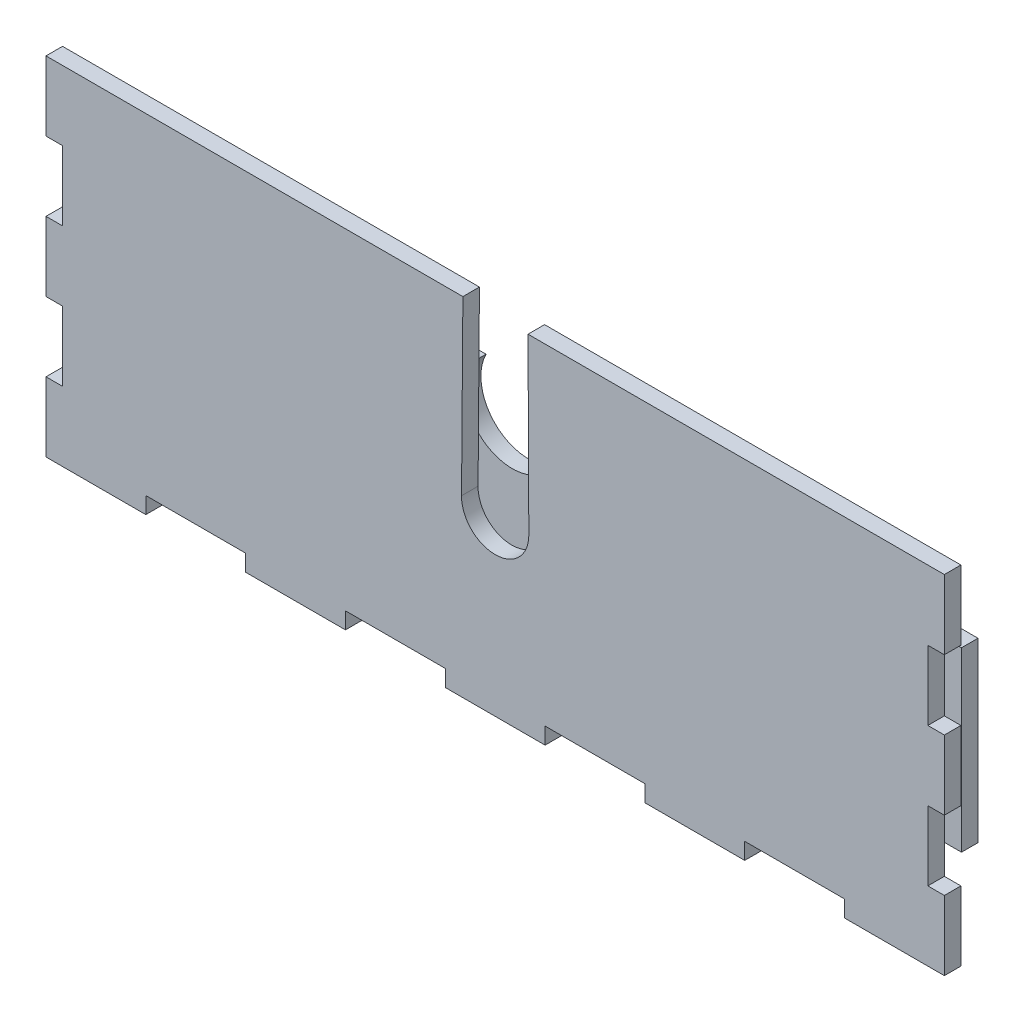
ISO-10303-21;
HEADER;
FILE_DESCRIPTION(('STEP AP214'),'2;1');
FILE_NAME('part.step','',(''),(''),'','','');
FILE_SCHEMA(('AUTOMOTIVE_DESIGN { 1 0 10303 214 1 1 1 1 }'));
ENDSEC;
DATA;
#1=APPLICATION_CONTEXT('core data for automotive mechanical design processes');
#2=APPLICATION_PROTOCOL_DEFINITION('international standard','automotive_design',2000,#1);
#3=PRODUCT_CONTEXT('',#1,'mechanical');
#4=PRODUCT('Part','Part','',(#3));
#5=PRODUCT_RELATED_PRODUCT_CATEGORY('part','',(#4));
#6=PRODUCT_DEFINITION_FORMATION('','',#4);
#7=PRODUCT_DEFINITION_CONTEXT('part definition',#1,'design');
#8=PRODUCT_DEFINITION('design','',#6,#7);
#9=PRODUCT_DEFINITION_SHAPE('','',#8);
#10=(LENGTH_UNIT() NAMED_UNIT(*) SI_UNIT(.MILLI.,.METRE.));
#11=(NAMED_UNIT(*) PLANE_ANGLE_UNIT() SI_UNIT($,.RADIAN.));
#12=(NAMED_UNIT(*) SI_UNIT($,.STERADIAN.) SOLID_ANGLE_UNIT());
#13=UNCERTAINTY_MEASURE_WITH_UNIT(LENGTH_MEASURE(1.E-05),#10,'distance_accuracy_value','');
#14=(GEOMETRIC_REPRESENTATION_CONTEXT(3) GLOBAL_UNCERTAINTY_ASSIGNED_CONTEXT((#13)) GLOBAL_UNIT_ASSIGNED_CONTEXT((#10,
#11,#12)) REPRESENTATION_CONTEXT('',''));
#15=CARTESIAN_POINT('',(0.,0.,0.));
#16=DIRECTION('',(0.,0.,1.));
#17=DIRECTION('',(1.,0.,0.));
#18=AXIS2_PLACEMENT_3D('',#15,#16,#17);
#19=CARTESIAN_POINT('',(0.,32.8963974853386,15.24));
#20=DIRECTION('',(1.,0.,0.));
#21=DIRECTION('',(0.,1.,0.));
#22=AXIS2_PLACEMENT_3D('',#19,#20,#21);
#23=PLANE('',#22);
#24=DIRECTION('',(0.,-1.,0.));
#25=VECTOR('',#24,1.);
#26=CARTESIAN_POINT('',(0.,32.8963974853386,7.62));
#27=LINE('',#26,#25);
#28=CARTESIAN_POINT('',(0.,32.8963974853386,7.62));
#29=VERTEX_POINT('',#28);
#30=CARTESIAN_POINT('',(0.,0.896397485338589,7.62));
#31=VERTEX_POINT('',#30);
#32=EDGE_CURVE('E336',#29,#31,#27,.T.);
#33=ORIENTED_EDGE('',*,*,#32,.T.);
#34=DIRECTION('',(0.,0.,-1.));
#35=VECTOR('',#34,1.);
#36=CARTESIAN_POINT('',(0.,0.896397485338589,15.24));
#37=LINE('',#36,#35);
#38=CARTESIAN_POINT('',(0.,0.896397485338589,15.24));
#39=VERTEX_POINT('',#38);
#40=EDGE_CURVE('E12',#39,#31,#37,.T.);
#41=ORIENTED_EDGE('',*,*,#40,.F.);
#42=DIRECTION('',(0.,-1.,0.));
#43=VECTOR('',#42,1.);
#44=CARTESIAN_POINT('',(0.,32.8963974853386,15.24));
#45=LINE('',#44,#43);
#46=CARTESIAN_POINT('',(0.,32.8963974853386,15.24));
#47=VERTEX_POINT('',#46);
#48=EDGE_CURVE('E414',#47,#39,#45,.T.);
#49=ORIENTED_EDGE('',*,*,#48,.F.);
#50=DIRECTION('',(0.,0.,-1.));
#51=VECTOR('',#50,1.);
#52=CARTESIAN_POINT('',(0.,32.8963974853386,15.24));
#53=LINE('',#52,#51);
#54=EDGE_CURVE('E332',#47,#29,#53,.T.);
#55=ORIENTED_EDGE('',*,*,#54,.T.);
#56=EDGE_LOOP('',(#33,#41,#49,#55));
#57=FACE_BOUND('',#56,.T.);
#58=ADVANCED_FACE('F48',(#57),#23,.F.);
#59=CARTESIAN_POINT('',(0.,0.896397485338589,15.24));
#60=DIRECTION('',(0.,1.,0.));
#61=DIRECTION('',(-1.,0.,0.));
#62=AXIS2_PLACEMENT_3D('',#59,#60,#61);
#63=PLANE('',#62);
#64=DIRECTION('',(1.,0.,0.));
#65=VECTOR('',#64,1.);
#66=CARTESIAN_POINT('',(0.,0.896397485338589,7.62));
#67=LINE('',#66,#65);
#68=CARTESIAN_POINT('',(7.62,0.896397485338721,7.62));
#69=VERTEX_POINT('',#68);
#70=EDGE_CURVE('E339',#31,#69,#67,.T.);
#71=ORIENTED_EDGE('',*,*,#70,.T.);
#72=DIRECTION('',(0.,0.,-1.));
#73=VECTOR('',#72,1.);
#74=CARTESIAN_POINT('',(7.62,0.896397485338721,15.24));
#75=LINE('',#74,#73);
#76=CARTESIAN_POINT('',(7.62,0.896397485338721,15.24));
#77=VERTEX_POINT('',#76);
#78=EDGE_CURVE('E56',#77,#69,#75,.T.);
#79=ORIENTED_EDGE('',*,*,#78,.F.);
#80=DIRECTION('',(1.,0.,0.));
#81=VECTOR('',#80,1.);
#82=CARTESIAN_POINT('',(0.,0.896397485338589,15.24));
#83=LINE('',#82,#81);
#84=EDGE_CURVE('E203',#39,#77,#83,.T.);
#85=ORIENTED_EDGE('',*,*,#84,.F.);
#86=ORIENTED_EDGE('',*,*,#40,.T.);
#87=EDGE_LOOP('',(#71,#79,#85,#86));
#88=FACE_BOUND('',#87,.T.);
#89=ADVANCED_FACE('F632',(#88),#63,.F.);
#90=CARTESIAN_POINT('',(7.62,0.896397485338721,15.24));
#91=DIRECTION('',(1.,0.,0.));
#92=DIRECTION('',(0.,1.,0.));
#93=AXIS2_PLACEMENT_3D('',#90,#91,#92);
#94=PLANE('',#93);
#95=DIRECTION('',(0.,-1.,0.));
#96=VECTOR('',#95,1.);
#97=CARTESIAN_POINT('',(7.62,0.896397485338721,7.62));
#98=LINE('',#97,#96);
#99=CARTESIAN_POINT('',(7.62000000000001,-31.1036025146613,7.62));
#100=VERTEX_POINT('',#99);
#101=EDGE_CURVE('E341',#69,#100,#98,.T.);
#102=ORIENTED_EDGE('',*,*,#101,.T.);
#103=DIRECTION('',(0.,0.,-1.));
#104=VECTOR('',#103,1.);
#105=CARTESIAN_POINT('',(7.62000000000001,-31.1036025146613,15.24));
#106=LINE('',#105,#104);
#107=CARTESIAN_POINT('',(7.62000000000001,-31.1036025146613,15.24));
#108=VERTEX_POINT('',#107);
#109=EDGE_CURVE('E517',#108,#100,#106,.T.);
#110=ORIENTED_EDGE('',*,*,#109,.F.);
#111=DIRECTION('',(0.,-1.,0.));
#112=VECTOR('',#111,1.);
#113=CARTESIAN_POINT('',(7.62,0.896397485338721,15.24));
#114=LINE('',#113,#112);
#115=EDGE_CURVE('E525',#77,#108,#114,.T.);
#116=ORIENTED_EDGE('',*,*,#115,.F.);
#117=ORIENTED_EDGE('',*,*,#78,.T.);
#118=EDGE_LOOP('',(#102,#110,#116,#117));
#119=FACE_BOUND('',#118,.T.);
#120=ADVANCED_FACE('F523',(#119),#94,.F.);
#121=CARTESIAN_POINT('',(7.62000000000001,-31.1036025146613,15.24));
#122=DIRECTION('',(0.,-1.,0.));
#123=DIRECTION('',(1.,0.,0.));
#124=AXIS2_PLACEMENT_3D('',#121,#122,#123);
#125=PLANE('',#124);
#126=DIRECTION('',(-1.,0.,0.));
#127=VECTOR('',#126,1.);
#128=CARTESIAN_POINT('',(7.62000000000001,-31.1036025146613,7.62));
#129=LINE('',#128,#127);
#130=CARTESIAN_POINT('',(0.,-31.1036025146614,7.62));
#131=VERTEX_POINT('',#130);
#132=EDGE_CURVE('E343',#100,#131,#129,.T.);
#133=ORIENTED_EDGE('',*,*,#132,.T.);
#134=DIRECTION('',(0.,0.,-1.));
#135=VECTOR('',#134,1.);
#136=CARTESIAN_POINT('',(0.,-31.1036025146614,15.24));
#137=LINE('',#136,#135);
#138=CARTESIAN_POINT('',(0.,-31.1036025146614,15.24));
#139=VERTEX_POINT('',#138);
#140=EDGE_CURVE('E514',#139,#131,#137,.T.);
#141=ORIENTED_EDGE('',*,*,#140,.F.);
#142=DIRECTION('',(-1.,0.,0.));
#143=VECTOR('',#142,1.);
#144=CARTESIAN_POINT('',(7.62000000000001,-31.1036025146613,15.24));
#145=LINE('',#144,#143);
#146=EDGE_CURVE('E543',#108,#139,#145,.T.);
#147=ORIENTED_EDGE('',*,*,#146,.F.);
#148=ORIENTED_EDGE('',*,*,#109,.T.);
#149=EDGE_LOOP('',(#133,#141,#147,#148));
#150=FACE_BOUND('',#149,.T.);
#151=ADVANCED_FACE('F534',(#150),#125,.F.);
#152=CARTESIAN_POINT('',(0.,-31.1036025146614,15.24));
#153=DIRECTION('',(1.,0.,0.));
#154=DIRECTION('',(0.,1.,0.));
#155=AXIS2_PLACEMENT_3D('',#152,#153,#154);
#156=PLANE('',#155);
#157=DIRECTION('',(0.,-1.,0.));
#158=VECTOR('',#157,1.);
#159=CARTESIAN_POINT('',(0.,-31.1036025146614,7.62));
#160=LINE('',#159,#158);
#161=CARTESIAN_POINT('',(0.,-63.1036025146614,7.62));
#162=VERTEX_POINT('',#161);
#163=EDGE_CURVE('E345',#131,#162,#160,.T.);
#164=ORIENTED_EDGE('',*,*,#163,.T.);
#165=DIRECTION('',(0.,0.,-1.));
#166=VECTOR('',#165,1.);
#167=CARTESIAN_POINT('',(0.,-63.1036025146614,15.24));
#168=LINE('',#167,#166);
#169=CARTESIAN_POINT('',(0.,-63.1036025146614,15.24));
#170=VERTEX_POINT('',#169);
#171=EDGE_CURVE('E511',#170,#162,#168,.T.);
#172=ORIENTED_EDGE('',*,*,#171,.F.);
#173=DIRECTION('',(0.,-1.,0.));
#174=VECTOR('',#173,1.);
#175=CARTESIAN_POINT('',(0.,-31.1036025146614,15.24));
#176=LINE('',#175,#174);
#177=EDGE_CURVE('E540',#139,#170,#176,.T.);
#178=ORIENTED_EDGE('',*,*,#177,.F.);
#179=ORIENTED_EDGE('',*,*,#140,.T.);
#180=EDGE_LOOP('',(#164,#172,#178,#179));
#181=FACE_BOUND('',#180,.T.);
#182=ADVANCED_FACE('F538',(#181),#156,.F.);
#183=CARTESIAN_POINT('',(0.,-63.1036025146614,15.24));
#184=DIRECTION('',(0.,1.,0.));
#185=DIRECTION('',(-1.,0.,0.));
#186=AXIS2_PLACEMENT_3D('',#183,#184,#185);
#187=PLANE('',#186);
#188=DIRECTION('',(1.,0.,0.));
#189=VECTOR('',#188,1.);
#190=CARTESIAN_POINT('',(0.,-63.1036025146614,7.62));
#191=LINE('',#190,#189);
#192=CARTESIAN_POINT('',(7.62,-63.1036025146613,7.62));
#193=VERTEX_POINT('',#192);
#194=EDGE_CURVE('E347',#162,#193,#191,.T.);
#195=ORIENTED_EDGE('',*,*,#194,.T.);
#196=DIRECTION('',(0.,0.,-1.));
#197=VECTOR('',#196,1.);
#198=CARTESIAN_POINT('',(7.62,-63.1036025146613,15.24));
#199=LINE('',#198,#197);
#200=CARTESIAN_POINT('',(7.62,-63.1036025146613,15.24));
#201=VERTEX_POINT('',#200);
#202=EDGE_CURVE('E508',#201,#193,#199,.T.);
#203=ORIENTED_EDGE('',*,*,#202,.F.);
#204=DIRECTION('',(1.,0.,0.));
#205=VECTOR('',#204,1.);
#206=CARTESIAN_POINT('',(0.,-63.1036025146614,15.24));
#207=LINE('',#206,#205);
#208=EDGE_CURVE('E542',#170,#201,#207,.T.);
#209=ORIENTED_EDGE('',*,*,#208,.F.);
#210=ORIENTED_EDGE('',*,*,#171,.T.);
#211=EDGE_LOOP('',(#195,#203,#209,#210));
#212=FACE_BOUND('',#211,.T.);
#213=ADVANCED_FACE('F645',(#212),#187,.F.);
#214=CARTESIAN_POINT('',(7.62,-63.1036025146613,15.24));
#215=DIRECTION('',(1.,0.,0.));
#216=DIRECTION('',(0.,1.,0.));
#217=AXIS2_PLACEMENT_3D('',#214,#215,#216);
#218=PLANE('',#217);
#219=DIRECTION('',(0.,-1.,0.));
#220=VECTOR('',#219,1.);
#221=CARTESIAN_POINT('',(7.62,-63.1036025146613,7.62));
#222=LINE('',#221,#220);
#223=CARTESIAN_POINT('',(7.62000000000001,-95.1036025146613,7.62));
#224=VERTEX_POINT('',#223);
#225=EDGE_CURVE('E349',#193,#224,#222,.T.);
#226=ORIENTED_EDGE('',*,*,#225,.T.);
#227=DIRECTION('',(0.,0.,-1.));
#228=VECTOR('',#227,1.);
#229=CARTESIAN_POINT('',(7.62000000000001,-95.1036025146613,15.24));
#230=LINE('',#229,#228);
#231=CARTESIAN_POINT('',(7.62000000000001,-95.1036025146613,15.24));
#232=VERTEX_POINT('',#231);
#233=EDGE_CURVE('E505',#232,#224,#230,.T.);
#234=ORIENTED_EDGE('',*,*,#233,.F.);
#235=DIRECTION('',(0.,-1.,0.));
#236=VECTOR('',#235,1.);
#237=CARTESIAN_POINT('',(7.62,-63.1036025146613,15.24));
#238=LINE('',#237,#236);
#239=EDGE_CURVE('E545',#201,#232,#238,.T.);
#240=ORIENTED_EDGE('',*,*,#239,.F.);
#241=ORIENTED_EDGE('',*,*,#202,.T.);
#242=EDGE_LOOP('',(#226,#234,#240,#241));
#243=FACE_BOUND('',#242,.T.);
#244=ADVANCED_FACE('F648',(#243),#218,.F.);
#245=CARTESIAN_POINT('',(7.62000000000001,-95.1036025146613,15.24));
#246=DIRECTION('',(0.,-1.,0.));
#247=DIRECTION('',(0.,0.,-1.));
#248=AXIS2_PLACEMENT_3D('',#245,#246,#247);
#249=PLANE('',#248);
#250=DIRECTION('',(-1.,0.,0.));
#251=VECTOR('',#250,1.);
#252=CARTESIAN_POINT('',(7.62000000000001,-95.1036025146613,7.62));
#253=LINE('',#252,#251);
#254=CARTESIAN_POINT('',(0.,-95.1036025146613,7.62));
#255=VERTEX_POINT('',#254);
#256=EDGE_CURVE('E351',#224,#255,#253,.T.);
#257=ORIENTED_EDGE('',*,*,#256,.T.);
#258=DIRECTION('',(0.,0.,-1.));
#259=VECTOR('',#258,1.);
#260=CARTESIAN_POINT('',(0.,-95.1036025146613,15.24));
#261=LINE('',#260,#259);
#262=CARTESIAN_POINT('',(0.,-95.1036025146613,15.24));
#263=VERTEX_POINT('',#262);
#264=EDGE_CURVE('E502',#263,#255,#261,.T.);
#265=ORIENTED_EDGE('',*,*,#264,.F.);
#266=DIRECTION('',(-1.,0.,0.));
#267=VECTOR('',#266,1.);
#268=CARTESIAN_POINT('',(7.62000000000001,-95.1036025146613,15.24));
#269=LINE('',#268,#267);
#270=EDGE_CURVE('E551',#232,#263,#269,.T.);
#271=ORIENTED_EDGE('',*,*,#270,.F.);
#272=ORIENTED_EDGE('',*,*,#233,.T.);
#273=EDGE_LOOP('',(#257,#265,#271,#272));
#274=FACE_BOUND('',#273,.T.);
#275=ADVANCED_FACE('F652',(#274),#249,.F.);
#276=CARTESIAN_POINT('',(0.,-95.1036025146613,15.24));
#277=DIRECTION('',(1.,0.,0.));
#278=DIRECTION('',(0.,1.,0.));
#279=AXIS2_PLACEMENT_3D('',#276,#277,#278);
#280=PLANE('',#279);
#281=DIRECTION('',(0.,-1.,0.));
#282=VECTOR('',#281,1.);
#283=CARTESIAN_POINT('',(0.,-95.1036025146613,7.62));
#284=LINE('',#283,#282);
#285=CARTESIAN_POINT('',(0.,-127.103602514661,7.62));
#286=VERTEX_POINT('',#285);
#287=EDGE_CURVE('E353',#255,#286,#284,.T.);
#288=ORIENTED_EDGE('',*,*,#287,.T.);
#289=DIRECTION('',(0.,0.,-1.));
#290=VECTOR('',#289,1.);
#291=CARTESIAN_POINT('',(0.,-127.103602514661,15.24));
#292=LINE('',#291,#290);
#293=CARTESIAN_POINT('',(0.,-127.103602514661,15.24));
#294=VERTEX_POINT('',#293);
#295=EDGE_CURVE('E499',#294,#286,#292,.T.);
#296=ORIENTED_EDGE('',*,*,#295,.F.);
#297=DIRECTION('',(0.,-1.,0.));
#298=VECTOR('',#297,1.);
#299=CARTESIAN_POINT('',(0.,-95.1036025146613,15.24));
#300=LINE('',#299,#298);
#301=EDGE_CURVE('E553',#263,#294,#300,.T.);
#302=ORIENTED_EDGE('',*,*,#301,.F.);
#303=ORIENTED_EDGE('',*,*,#264,.T.);
#304=EDGE_LOOP('',(#288,#296,#302,#303));
#305=FACE_BOUND('',#304,.T.);
#306=ADVANCED_FACE('F656',(#305),#280,.F.);
#307=CARTESIAN_POINT('',(45.974,-127.103602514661,15.24));
#308=DIRECTION('',(0.,1.,0.));
#309=DIRECTION('',(0.,0.,1.));
#310=AXIS2_PLACEMENT_3D('',#307,#308,#309);
#311=PLANE('',#310);
#312=DIRECTION('',(1.,0.,0.));
#313=VECTOR('',#312,1.);
#314=CARTESIAN_POINT('',(45.974,-127.103602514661,7.62));
#315=LINE('',#314,#313);
#316=CARTESIAN_POINT('',(45.974,-127.103602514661,7.62));
#317=VERTEX_POINT('',#316);
#318=EDGE_CURVE('E355',#286,#317,#315,.T.);
#319=ORIENTED_EDGE('',*,*,#318,.T.);
#320=DIRECTION('',(0.,0.,-1.));
#321=VECTOR('',#320,1.);
#322=CARTESIAN_POINT('',(45.974,-127.103602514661,15.24));
#323=LINE('',#322,#321);
#324=CARTESIAN_POINT('',(45.974,-127.103602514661,15.24));
#325=VERTEX_POINT('',#324);
#326=EDGE_CURVE('E496',#325,#317,#323,.T.);
#327=ORIENTED_EDGE('',*,*,#326,.F.);
#328=DIRECTION('',(1.,0.,0.));
#329=VECTOR('',#328,1.);
#330=CARTESIAN_POINT('',(45.974,-127.103602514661,15.24));
#331=LINE('',#330,#329);
#332=EDGE_CURVE('E555',#294,#325,#331,.T.);
#333=ORIENTED_EDGE('',*,*,#332,.F.);
#334=ORIENTED_EDGE('',*,*,#295,.T.);
#335=EDGE_LOOP('',(#319,#327,#333,#334));
#336=FACE_BOUND('',#335,.T.);
#337=ADVANCED_FACE('F660',(#336),#311,.F.);
#338=CARTESIAN_POINT('',(45.974,-119.483602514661,15.24));
#339=DIRECTION('',(-1.,0.,0.));
#340=DIRECTION('',(0.,0.,1.));
#341=AXIS2_PLACEMENT_3D('',#338,#339,#340);
#342=PLANE('',#341);
#343=DIRECTION('',(0.,1.,0.));
#344=VECTOR('',#343,1.);
#345=CARTESIAN_POINT('',(45.974,-119.483602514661,7.62));
#346=LINE('',#345,#344);
#347=CARTESIAN_POINT('',(45.974,-119.483602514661,7.62));
#348=VERTEX_POINT('',#347);
#349=EDGE_CURVE('E357',#317,#348,#346,.T.);
#350=ORIENTED_EDGE('',*,*,#349,.T.);
#351=DIRECTION('',(0.,0.,-1.));
#352=VECTOR('',#351,1.);
#353=CARTESIAN_POINT('',(45.974,-119.483602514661,15.24));
#354=LINE('',#353,#352);
#355=CARTESIAN_POINT('',(45.974,-119.483602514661,15.24));
#356=VERTEX_POINT('',#355);
#357=EDGE_CURVE('E493',#356,#348,#354,.T.);
#358=ORIENTED_EDGE('',*,*,#357,.F.);
#359=DIRECTION('',(0.,1.,0.));
#360=VECTOR('',#359,1.);
#361=CARTESIAN_POINT('',(45.974,-119.483602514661,15.24));
#362=LINE('',#361,#360);
#363=EDGE_CURVE('E557',#325,#356,#362,.T.);
#364=ORIENTED_EDGE('',*,*,#363,.F.);
#365=ORIENTED_EDGE('',*,*,#326,.T.);
#366=EDGE_LOOP('',(#350,#358,#364,#365));
#367=FACE_BOUND('',#366,.T.);
#368=ADVANCED_FACE('F664',(#367),#342,.F.);
#369=CARTESIAN_POINT('',(91.948,-119.483602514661,15.24));
#370=DIRECTION('',(0.,1.,0.));
#371=DIRECTION('',(-1.,0.,0.));
#372=AXIS2_PLACEMENT_3D('',#369,#370,#371);
#373=PLANE('',#372);
#374=DIRECTION('',(1.,0.,0.));
#375=VECTOR('',#374,1.);
#376=CARTESIAN_POINT('',(91.948,-119.483602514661,7.62));
#377=LINE('',#376,#375);
#378=CARTESIAN_POINT('',(91.948,-119.483602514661,7.62));
#379=VERTEX_POINT('',#378);
#380=EDGE_CURVE('E359',#348,#379,#377,.T.);
#381=ORIENTED_EDGE('',*,*,#380,.T.);
#382=DIRECTION('',(0.,0.,-1.));
#383=VECTOR('',#382,1.);
#384=CARTESIAN_POINT('',(91.948,-119.483602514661,15.24));
#385=LINE('',#384,#383);
#386=CARTESIAN_POINT('',(91.948,-119.483602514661,15.24));
#387=VERTEX_POINT('',#386);
#388=EDGE_CURVE('E490',#387,#379,#385,.T.);
#389=ORIENTED_EDGE('',*,*,#388,.F.);
#390=DIRECTION('',(1.,0.,0.));
#391=VECTOR('',#390,1.);
#392=CARTESIAN_POINT('',(91.948,-119.483602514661,15.24));
#393=LINE('',#392,#391);
#394=EDGE_CURVE('E559',#356,#387,#393,.T.);
#395=ORIENTED_EDGE('',*,*,#394,.F.);
#396=ORIENTED_EDGE('',*,*,#357,.T.);
#397=EDGE_LOOP('',(#381,#389,#395,#396));
#398=FACE_BOUND('',#397,.T.);
#399=ADVANCED_FACE('F668',(#398),#373,.F.);
#400=CARTESIAN_POINT('',(91.948,-127.103602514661,15.24));
#401=DIRECTION('',(1.,0.,0.));
#402=DIRECTION('',(0.,0.,-1.));
#403=AXIS2_PLACEMENT_3D('',#400,#401,#402);
#404=PLANE('',#403);
#405=DIRECTION('',(0.,-1.,0.));
#406=VECTOR('',#405,1.);
#407=CARTESIAN_POINT('',(91.948,-127.103602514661,7.62));
#408=LINE('',#407,#406);
#409=CARTESIAN_POINT('',(91.948,-127.103602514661,7.62));
#410=VERTEX_POINT('',#409);
#411=EDGE_CURVE('E361',#379,#410,#408,.T.);
#412=ORIENTED_EDGE('',*,*,#411,.T.);
#413=DIRECTION('',(0.,0.,-1.));
#414=VECTOR('',#413,1.);
#415=CARTESIAN_POINT('',(91.948,-127.103602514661,15.24));
#416=LINE('',#415,#414);
#417=CARTESIAN_POINT('',(91.948,-127.103602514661,15.24));
#418=VERTEX_POINT('',#417);
#419=EDGE_CURVE('E487',#418,#410,#416,.T.);
#420=ORIENTED_EDGE('',*,*,#419,.F.);
#421=DIRECTION('',(0.,-1.,0.));
#422=VECTOR('',#421,1.);
#423=CARTESIAN_POINT('',(91.948,-127.103602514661,15.24));
#424=LINE('',#423,#422);
#425=EDGE_CURVE('E561',#387,#418,#424,.T.);
#426=ORIENTED_EDGE('',*,*,#425,.F.);
#427=ORIENTED_EDGE('',*,*,#388,.T.);
#428=EDGE_LOOP('',(#412,#420,#426,#427));
#429=FACE_BOUND('',#428,.T.);
#430=ADVANCED_FACE('F672',(#429),#404,.F.);
#431=CARTESIAN_POINT('',(137.922,-127.103602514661,15.24));
#432=DIRECTION('',(0.,1.,0.));
#433=DIRECTION('',(-1.,0.,0.));
#434=AXIS2_PLACEMENT_3D('',#431,#432,#433);
#435=PLANE('',#434);
#436=DIRECTION('',(1.,0.,0.));
#437=VECTOR('',#436,1.);
#438=CARTESIAN_POINT('',(137.922,-127.103602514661,7.62));
#439=LINE('',#438,#437);
#440=CARTESIAN_POINT('',(137.922,-127.103602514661,7.62));
#441=VERTEX_POINT('',#440);
#442=EDGE_CURVE('E363',#410,#441,#439,.T.);
#443=ORIENTED_EDGE('',*,*,#442,.T.);
#444=DIRECTION('',(0.,0.,-1.));
#445=VECTOR('',#444,1.);
#446=CARTESIAN_POINT('',(137.922,-127.103602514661,15.24));
#447=LINE('',#446,#445);
#448=CARTESIAN_POINT('',(137.922,-127.103602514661,15.24));
#449=VERTEX_POINT('',#448);
#450=EDGE_CURVE('E484',#449,#441,#447,.T.);
#451=ORIENTED_EDGE('',*,*,#450,.F.);
#452=DIRECTION('',(1.,0.,0.));
#453=VECTOR('',#452,1.);
#454=CARTESIAN_POINT('',(137.922,-127.103602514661,15.24));
#455=LINE('',#454,#453);
#456=EDGE_CURVE('E563',#418,#449,#455,.T.);
#457=ORIENTED_EDGE('',*,*,#456,.F.);
#458=ORIENTED_EDGE('',*,*,#419,.T.);
#459=EDGE_LOOP('',(#443,#451,#457,#458));
#460=FACE_BOUND('',#459,.T.);
#461=ADVANCED_FACE('F676',(#460),#435,.F.);
#462=CARTESIAN_POINT('',(137.922,-119.483602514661,15.24));
#463=DIRECTION('',(-1.,0.,0.));
#464=DIRECTION('',(0.,-1.,0.));
#465=AXIS2_PLACEMENT_3D('',#462,#463,#464);
#466=PLANE('',#465);
#467=DIRECTION('',(0.,1.,0.));
#468=VECTOR('',#467,1.);
#469=CARTESIAN_POINT('',(137.922,-119.483602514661,7.62));
#470=LINE('',#469,#468);
#471=CARTESIAN_POINT('',(137.922,-119.483602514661,7.62));
#472=VERTEX_POINT('',#471);
#473=EDGE_CURVE('E365',#441,#472,#470,.T.);
#474=ORIENTED_EDGE('',*,*,#473,.T.);
#475=DIRECTION('',(0.,0.,-1.));
#476=VECTOR('',#475,1.);
#477=CARTESIAN_POINT('',(137.922,-119.483602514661,15.24));
#478=LINE('',#477,#476);
#479=CARTESIAN_POINT('',(137.922,-119.483602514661,15.24));
#480=VERTEX_POINT('',#479);
#481=EDGE_CURVE('E481',#480,#472,#478,.T.);
#482=ORIENTED_EDGE('',*,*,#481,.F.);
#483=DIRECTION('',(0.,1.,0.));
#484=VECTOR('',#483,1.);
#485=CARTESIAN_POINT('',(137.922,-119.483602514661,15.24));
#486=LINE('',#485,#484);
#487=EDGE_CURVE('E565',#449,#480,#486,.T.);
#488=ORIENTED_EDGE('',*,*,#487,.F.);
#489=ORIENTED_EDGE('',*,*,#450,.T.);
#490=EDGE_LOOP('',(#474,#482,#488,#489));
#491=FACE_BOUND('',#490,.T.);
#492=ADVANCED_FACE('F680',(#491),#466,.F.);
#493=CARTESIAN_POINT('',(183.896,-119.483602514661,15.24));
#494=DIRECTION('',(0.,1.,0.));
#495=DIRECTION('',(-1.,0.,0.));
#496=AXIS2_PLACEMENT_3D('',#493,#494,#495);
#497=PLANE('',#496);
#498=DIRECTION('',(1.,0.,0.));
#499=VECTOR('',#498,1.);
#500=CARTESIAN_POINT('',(183.896,-119.483602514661,7.62));
#501=LINE('',#500,#499);
#502=CARTESIAN_POINT('',(183.896,-119.483602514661,7.62));
#503=VERTEX_POINT('',#502);
#504=EDGE_CURVE('E367',#472,#503,#501,.T.);
#505=ORIENTED_EDGE('',*,*,#504,.T.);
#506=DIRECTION('',(0.,0.,-1.));
#507=VECTOR('',#506,1.);
#508=CARTESIAN_POINT('',(183.896,-119.483602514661,15.24));
#509=LINE('',#508,#507);
#510=CARTESIAN_POINT('',(183.896,-119.483602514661,15.24));
#511=VERTEX_POINT('',#510);
#512=EDGE_CURVE('E478',#511,#503,#509,.T.);
#513=ORIENTED_EDGE('',*,*,#512,.F.);
#514=DIRECTION('',(1.,0.,0.));
#515=VECTOR('',#514,1.);
#516=CARTESIAN_POINT('',(183.896,-119.483602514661,15.24));
#517=LINE('',#516,#515);
#518=EDGE_CURVE('E567',#480,#511,#517,.T.);
#519=ORIENTED_EDGE('',*,*,#518,.F.);
#520=ORIENTED_EDGE('',*,*,#481,.T.);
#521=EDGE_LOOP('',(#505,#513,#519,#520));
#522=FACE_BOUND('',#521,.T.);
#523=ADVANCED_FACE('F684',(#522),#497,.F.);
#524=CARTESIAN_POINT('',(183.896,-127.103602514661,15.24));
#525=DIRECTION('',(1.,0.,0.));
#526=DIRECTION('',(0.,0.,-1.));
#527=AXIS2_PLACEMENT_3D('',#524,#525,#526);
#528=PLANE('',#527);
#529=DIRECTION('',(0.,-1.,0.));
#530=VECTOR('',#529,1.);
#531=CARTESIAN_POINT('',(183.896,-127.103602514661,7.62));
#532=LINE('',#531,#530);
#533=CARTESIAN_POINT('',(183.896,-127.103602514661,7.62));
#534=VERTEX_POINT('',#533);
#535=EDGE_CURVE('E369',#503,#534,#532,.T.);
#536=ORIENTED_EDGE('',*,*,#535,.T.);
#537=DIRECTION('',(0.,0.,-1.));
#538=VECTOR('',#537,1.);
#539=CARTESIAN_POINT('',(183.896,-127.103602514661,15.24));
#540=LINE('',#539,#538);
#541=CARTESIAN_POINT('',(183.896,-127.103602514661,15.24));
#542=VERTEX_POINT('',#541);
#543=EDGE_CURVE('E475',#542,#534,#540,.T.);
#544=ORIENTED_EDGE('',*,*,#543,.F.);
#545=DIRECTION('',(0.,-1.,0.));
#546=VECTOR('',#545,1.);
#547=CARTESIAN_POINT('',(183.896,-127.103602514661,15.24));
#548=LINE('',#547,#546);
#549=EDGE_CURVE('E569',#511,#542,#548,.T.);
#550=ORIENTED_EDGE('',*,*,#549,.F.);
#551=ORIENTED_EDGE('',*,*,#512,.T.);
#552=EDGE_LOOP('',(#536,#544,#550,#551));
#553=FACE_BOUND('',#552,.T.);
#554=ADVANCED_FACE('F688',(#553),#528,.F.);
#555=CARTESIAN_POINT('',(229.87,-127.103602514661,15.24));
#556=DIRECTION('',(0.,1.,0.));
#557=DIRECTION('',(-1.,0.,0.));
#558=AXIS2_PLACEMENT_3D('',#555,#556,#557);
#559=PLANE('',#558);
#560=DIRECTION('',(1.,0.,0.));
#561=VECTOR('',#560,1.);
#562=CARTESIAN_POINT('',(229.87,-127.103602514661,7.62));
#563=LINE('',#562,#561);
#564=CARTESIAN_POINT('',(229.87,-127.103602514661,7.62));
#565=VERTEX_POINT('',#564);
#566=EDGE_CURVE('E371',#534,#565,#563,.T.);
#567=ORIENTED_EDGE('',*,*,#566,.T.);
#568=DIRECTION('',(0.,0.,-1.));
#569=VECTOR('',#568,1.);
#570=CARTESIAN_POINT('',(229.87,-127.103602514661,15.24));
#571=LINE('',#570,#569);
#572=CARTESIAN_POINT('',(229.87,-127.103602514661,15.24));
#573=VERTEX_POINT('',#572);
#574=EDGE_CURVE('E472',#573,#565,#571,.T.);
#575=ORIENTED_EDGE('',*,*,#574,.F.);
#576=DIRECTION('',(1.,0.,0.));
#577=VECTOR('',#576,1.);
#578=CARTESIAN_POINT('',(229.87,-127.103602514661,15.24));
#579=LINE('',#578,#577);
#580=EDGE_CURVE('E571',#542,#573,#579,.T.);
#581=ORIENTED_EDGE('',*,*,#580,.F.);
#582=ORIENTED_EDGE('',*,*,#543,.T.);
#583=EDGE_LOOP('',(#567,#575,#581,#582));
#584=FACE_BOUND('',#583,.T.);
#585=ADVANCED_FACE('F692',(#584),#559,.F.);
#586=CARTESIAN_POINT('',(229.87,-119.483602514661,15.24));
#587=DIRECTION('',(-1.,0.,0.));
#588=DIRECTION('',(0.,-1.,0.));
#589=AXIS2_PLACEMENT_3D('',#586,#587,#588);
#590=PLANE('',#589);
#591=DIRECTION('',(0.,1.,0.));
#592=VECTOR('',#591,1.);
#593=CARTESIAN_POINT('',(229.87,-119.483602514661,7.62));
#594=LINE('',#593,#592);
#595=CARTESIAN_POINT('',(229.87,-119.483602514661,7.62));
#596=VERTEX_POINT('',#595);
#597=EDGE_CURVE('E373',#565,#596,#594,.T.);
#598=ORIENTED_EDGE('',*,*,#597,.T.);
#599=DIRECTION('',(0.,0.,-1.));
#600=VECTOR('',#599,1.);
#601=CARTESIAN_POINT('',(229.87,-119.483602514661,15.24));
#602=LINE('',#601,#600);
#603=CARTESIAN_POINT('',(229.87,-119.483602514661,15.24));
#604=VERTEX_POINT('',#603);
#605=EDGE_CURVE('E469',#604,#596,#602,.T.);
#606=ORIENTED_EDGE('',*,*,#605,.F.);
#607=DIRECTION('',(0.,1.,0.));
#608=VECTOR('',#607,1.);
#609=CARTESIAN_POINT('',(229.87,-119.483602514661,15.24));
#610=LINE('',#609,#608);
#611=EDGE_CURVE('E573',#573,#604,#610,.T.);
#612=ORIENTED_EDGE('',*,*,#611,.F.);
#613=ORIENTED_EDGE('',*,*,#574,.T.);
#614=EDGE_LOOP('',(#598,#606,#612,#613));
#615=FACE_BOUND('',#614,.T.);
#616=ADVANCED_FACE('F696',(#615),#590,.F.);
#617=CARTESIAN_POINT('',(275.844,-119.483602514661,15.24));
#618=DIRECTION('',(0.,1.,0.));
#619=DIRECTION('',(-1.,0.,0.));
#620=AXIS2_PLACEMENT_3D('',#617,#618,#619);
#621=PLANE('',#620);
#622=DIRECTION('',(1.,0.,0.));
#623=VECTOR('',#622,1.);
#624=CARTESIAN_POINT('',(275.844,-119.483602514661,7.62));
#625=LINE('',#624,#623);
#626=CARTESIAN_POINT('',(275.844,-119.483602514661,7.62));
#627=VERTEX_POINT('',#626);
#628=EDGE_CURVE('E375',#596,#627,#625,.T.);
#629=ORIENTED_EDGE('',*,*,#628,.T.);
#630=DIRECTION('',(0.,0.,-1.));
#631=VECTOR('',#630,1.);
#632=CARTESIAN_POINT('',(275.844,-119.483602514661,15.24));
#633=LINE('',#632,#631);
#634=CARTESIAN_POINT('',(275.844,-119.483602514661,15.24));
#635=VERTEX_POINT('',#634);
#636=EDGE_CURVE('E466',#635,#627,#633,.T.);
#637=ORIENTED_EDGE('',*,*,#636,.F.);
#638=DIRECTION('',(1.,0.,0.));
#639=VECTOR('',#638,1.);
#640=CARTESIAN_POINT('',(275.844,-119.483602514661,15.24));
#641=LINE('',#640,#639);
#642=EDGE_CURVE('E575',#604,#635,#641,.T.);
#643=ORIENTED_EDGE('',*,*,#642,.F.);
#644=ORIENTED_EDGE('',*,*,#605,.T.);
#645=EDGE_LOOP('',(#629,#637,#643,#644));
#646=FACE_BOUND('',#645,.T.);
#647=ADVANCED_FACE('F700',(#646),#621,.F.);
#648=CARTESIAN_POINT('',(275.844,-127.103602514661,15.24));
#649=DIRECTION('',(1.,0.,0.));
#650=DIRECTION('',(0.,0.,-1.));
#651=AXIS2_PLACEMENT_3D('',#648,#649,#650);
#652=PLANE('',#651);
#653=DIRECTION('',(0.,-1.,0.));
#654=VECTOR('',#653,1.);
#655=CARTESIAN_POINT('',(275.844,-127.103602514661,7.62));
#656=LINE('',#655,#654);
#657=CARTESIAN_POINT('',(275.844,-127.103602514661,7.62));
#658=VERTEX_POINT('',#657);
#659=EDGE_CURVE('E377',#627,#658,#656,.T.);
#660=ORIENTED_EDGE('',*,*,#659,.T.);
#661=DIRECTION('',(0.,0.,-1.));
#662=VECTOR('',#661,1.);
#663=CARTESIAN_POINT('',(275.844,-127.103602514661,15.24));
#664=LINE('',#663,#662);
#665=CARTESIAN_POINT('',(275.844,-127.103602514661,15.24));
#666=VERTEX_POINT('',#665);
#667=EDGE_CURVE('E463',#666,#658,#664,.T.);
#668=ORIENTED_EDGE('',*,*,#667,.F.);
#669=DIRECTION('',(0.,-1.,0.));
#670=VECTOR('',#669,1.);
#671=CARTESIAN_POINT('',(275.844,-127.103602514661,15.24));
#672=LINE('',#671,#670);
#673=EDGE_CURVE('E577',#635,#666,#672,.T.);
#674=ORIENTED_EDGE('',*,*,#673,.F.);
#675=ORIENTED_EDGE('',*,*,#636,.T.);
#676=EDGE_LOOP('',(#660,#668,#674,#675));
#677=FACE_BOUND('',#676,.T.);
#678=ADVANCED_FACE('F704',(#677),#652,.F.);
#679=CARTESIAN_POINT('',(321.818,-127.103602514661,15.24));
#680=DIRECTION('',(0.,1.,0.));
#681=DIRECTION('',(-1.,0.,0.));
#682=AXIS2_PLACEMENT_3D('',#679,#680,#681);
#683=PLANE('',#682);
#684=DIRECTION('',(1.,0.,0.));
#685=VECTOR('',#684,1.);
#686=CARTESIAN_POINT('',(321.818,-127.103602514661,7.62));
#687=LINE('',#686,#685);
#688=CARTESIAN_POINT('',(321.818,-127.103602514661,7.62));
#689=VERTEX_POINT('',#688);
#690=EDGE_CURVE('E379',#658,#689,#687,.T.);
#691=ORIENTED_EDGE('',*,*,#690,.T.);
#692=DIRECTION('',(0.,0.,-1.));
#693=VECTOR('',#692,1.);
#694=CARTESIAN_POINT('',(321.818,-127.103602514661,15.24));
#695=LINE('',#694,#693);
#696=CARTESIAN_POINT('',(321.818,-127.103602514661,15.24));
#697=VERTEX_POINT('',#696);
#698=EDGE_CURVE('E460',#697,#689,#695,.T.);
#699=ORIENTED_EDGE('',*,*,#698,.F.);
#700=DIRECTION('',(1.,0.,0.));
#701=VECTOR('',#700,1.);
#702=CARTESIAN_POINT('',(321.818,-127.103602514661,15.24));
#703=LINE('',#702,#701);
#704=EDGE_CURVE('E579',#666,#697,#703,.T.);
#705=ORIENTED_EDGE('',*,*,#704,.F.);
#706=ORIENTED_EDGE('',*,*,#667,.T.);
#707=EDGE_LOOP('',(#691,#699,#705,#706));
#708=FACE_BOUND('',#707,.T.);
#709=ADVANCED_FACE('F708',(#708),#683,.F.);
#710=CARTESIAN_POINT('',(321.818,-119.483602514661,15.24));
#711=DIRECTION('',(-1.,0.,0.));
#712=DIRECTION('',(0.,-1.,0.));
#713=AXIS2_PLACEMENT_3D('',#710,#711,#712);
#714=PLANE('',#713);
#715=DIRECTION('',(0.,1.,0.));
#716=VECTOR('',#715,1.);
#717=CARTESIAN_POINT('',(321.818,-119.483602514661,7.62));
#718=LINE('',#717,#716);
#719=CARTESIAN_POINT('',(321.818,-119.483602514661,7.62));
#720=VERTEX_POINT('',#719);
#721=EDGE_CURVE('E381',#689,#720,#718,.T.);
#722=ORIENTED_EDGE('',*,*,#721,.T.);
#723=DIRECTION('',(0.,0.,-1.));
#724=VECTOR('',#723,1.);
#725=CARTESIAN_POINT('',(321.818,-119.483602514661,15.24));
#726=LINE('',#725,#724);
#727=CARTESIAN_POINT('',(321.818,-119.483602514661,15.24));
#728=VERTEX_POINT('',#727);
#729=EDGE_CURVE('E457',#728,#720,#726,.T.);
#730=ORIENTED_EDGE('',*,*,#729,.F.);
#731=DIRECTION('',(0.,1.,0.));
#732=VECTOR('',#731,1.);
#733=CARTESIAN_POINT('',(321.818,-119.483602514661,15.24));
#734=LINE('',#733,#732);
#735=EDGE_CURVE('E581',#697,#728,#734,.T.);
#736=ORIENTED_EDGE('',*,*,#735,.F.);
#737=ORIENTED_EDGE('',*,*,#698,.T.);
#738=EDGE_LOOP('',(#722,#730,#736,#737));
#739=FACE_BOUND('',#738,.T.);
#740=ADVANCED_FACE('F712',(#739),#714,.F.);
#741=CARTESIAN_POINT('',(367.792,-119.483602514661,15.24));
#742=DIRECTION('',(0.,1.,0.));
#743=DIRECTION('',(0.,0.,1.));
#744=AXIS2_PLACEMENT_3D('',#741,#742,#743);
#745=PLANE('',#744);
#746=DIRECTION('',(1.,0.,0.));
#747=VECTOR('',#746,1.);
#748=CARTESIAN_POINT('',(367.792,-119.483602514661,7.62));
#749=LINE('',#748,#747);
#750=CARTESIAN_POINT('',(367.792,-119.483602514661,7.62));
#751=VERTEX_POINT('',#750);
#752=EDGE_CURVE('E383',#720,#751,#749,.T.);
#753=ORIENTED_EDGE('',*,*,#752,.T.);
#754=DIRECTION('',(0.,0.,-1.));
#755=VECTOR('',#754,1.);
#756=CARTESIAN_POINT('',(367.792,-119.483602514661,15.24));
#757=LINE('',#756,#755);
#758=CARTESIAN_POINT('',(367.792,-119.483602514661,15.24));
#759=VERTEX_POINT('',#758);
#760=EDGE_CURVE('E454',#759,#751,#757,.T.);
#761=ORIENTED_EDGE('',*,*,#760,.F.);
#762=DIRECTION('',(1.,0.,0.));
#763=VECTOR('',#762,1.);
#764=CARTESIAN_POINT('',(367.792,-119.483602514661,15.24));
#765=LINE('',#764,#763);
#766=EDGE_CURVE('E583',#728,#759,#765,.T.);
#767=ORIENTED_EDGE('',*,*,#766,.F.);
#768=ORIENTED_EDGE('',*,*,#729,.T.);
#769=EDGE_LOOP('',(#753,#761,#767,#768));
#770=FACE_BOUND('',#769,.T.);
#771=ADVANCED_FACE('F716',(#770),#745,.F.);
#772=CARTESIAN_POINT('',(367.792,-127.103602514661,15.24));
#773=DIRECTION('',(1.,0.,0.));
#774=DIRECTION('',(0.,0.,-1.));
#775=AXIS2_PLACEMENT_3D('',#772,#773,#774);
#776=PLANE('',#775);
#777=DIRECTION('',(0.,-1.,0.));
#778=VECTOR('',#777,1.);
#779=CARTESIAN_POINT('',(367.792,-127.103602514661,7.62));
#780=LINE('',#779,#778);
#781=CARTESIAN_POINT('',(367.792,-127.103602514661,7.62));
#782=VERTEX_POINT('',#781);
#783=EDGE_CURVE('E385',#751,#782,#780,.T.);
#784=ORIENTED_EDGE('',*,*,#783,.T.);
#785=DIRECTION('',(0.,0.,-1.));
#786=VECTOR('',#785,1.);
#787=CARTESIAN_POINT('',(367.792,-127.103602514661,15.24));
#788=LINE('',#787,#786);
#789=CARTESIAN_POINT('',(367.792,-127.103602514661,15.24));
#790=VERTEX_POINT('',#789);
#791=EDGE_CURVE('E451',#790,#782,#788,.T.);
#792=ORIENTED_EDGE('',*,*,#791,.F.);
#793=DIRECTION('',(0.,-1.,0.));
#794=VECTOR('',#793,1.);
#795=CARTESIAN_POINT('',(367.792,-127.103602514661,15.24));
#796=LINE('',#795,#794);
#797=EDGE_CURVE('E585',#759,#790,#796,.T.);
#798=ORIENTED_EDGE('',*,*,#797,.F.);
#799=ORIENTED_EDGE('',*,*,#760,.T.);
#800=EDGE_LOOP('',(#784,#792,#798,#799));
#801=FACE_BOUND('',#800,.T.);
#802=ADVANCED_FACE('F720',(#801),#776,.F.);
#803=CARTESIAN_POINT('',(413.766,-127.103602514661,15.24));
#804=DIRECTION('',(0.,1.,0.));
#805=DIRECTION('',(-1.,0.,0.));
#806=AXIS2_PLACEMENT_3D('',#803,#804,#805);
#807=PLANE('',#806);
#808=DIRECTION('',(1.,0.,0.));
#809=VECTOR('',#808,1.);
#810=CARTESIAN_POINT('',(413.766,-127.103602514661,7.62));
#811=LINE('',#810,#809);
#812=CARTESIAN_POINT('',(413.766,-127.103602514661,7.62));
#813=VERTEX_POINT('',#812);
#814=EDGE_CURVE('E387',#782,#813,#811,.T.);
#815=ORIENTED_EDGE('',*,*,#814,.T.);
#816=DIRECTION('',(0.,0.,-1.));
#817=VECTOR('',#816,1.);
#818=CARTESIAN_POINT('',(413.766,-127.103602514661,15.24));
#819=LINE('',#818,#817);
#820=CARTESIAN_POINT('',(413.766,-127.103602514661,15.24));
#821=VERTEX_POINT('',#820);
#822=EDGE_CURVE('E448',#821,#813,#819,.T.);
#823=ORIENTED_EDGE('',*,*,#822,.F.);
#824=DIRECTION('',(1.,0.,0.));
#825=VECTOR('',#824,1.);
#826=CARTESIAN_POINT('',(413.766,-127.103602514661,15.24));
#827=LINE('',#826,#825);
#828=EDGE_CURVE('E587',#790,#821,#827,.T.);
#829=ORIENTED_EDGE('',*,*,#828,.F.);
#830=ORIENTED_EDGE('',*,*,#791,.T.);
#831=EDGE_LOOP('',(#815,#823,#829,#830));
#832=FACE_BOUND('',#831,.T.);
#833=ADVANCED_FACE('F724',(#832),#807,.F.);
#834=CARTESIAN_POINT('',(413.766,-95.1036025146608,15.24));
#835=DIRECTION('',(-1.,0.,0.));
#836=DIRECTION('',(0.,0.,1.));
#837=AXIS2_PLACEMENT_3D('',#834,#835,#836);
#838=PLANE('',#837);
#839=DIRECTION('',(0.,1.,0.));
#840=VECTOR('',#839,1.);
#841=CARTESIAN_POINT('',(413.766,-95.1036025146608,7.62));
#842=LINE('',#841,#840);
#843=CARTESIAN_POINT('',(413.766,-95.1036025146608,7.62));
#844=VERTEX_POINT('',#843);
#845=EDGE_CURVE('E389',#813,#844,#842,.T.);
#846=ORIENTED_EDGE('',*,*,#845,.T.);
#847=DIRECTION('',(0.,0.,-1.));
#848=VECTOR('',#847,1.);
#849=CARTESIAN_POINT('',(413.766,-95.1036025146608,15.24));
#850=LINE('',#849,#848);
#851=CARTESIAN_POINT('',(413.766,-95.1036025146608,15.24));
#852=VERTEX_POINT('',#851);
#853=EDGE_CURVE('E445',#852,#844,#850,.T.);
#854=ORIENTED_EDGE('',*,*,#853,.F.);
#855=DIRECTION('',(0.,1.,0.));
#856=VECTOR('',#855,1.);
#857=CARTESIAN_POINT('',(413.766,-95.1036025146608,15.24));
#858=LINE('',#857,#856);
#859=EDGE_CURVE('E589',#821,#852,#858,.T.);
#860=ORIENTED_EDGE('',*,*,#859,.F.);
#861=ORIENTED_EDGE('',*,*,#822,.T.);
#862=EDGE_LOOP('',(#846,#854,#860,#861));
#863=FACE_BOUND('',#862,.T.);
#864=ADVANCED_FACE('F728',(#863),#838,.F.);
#865=CARTESIAN_POINT('',(406.146,-95.1036025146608,15.24));
#866=DIRECTION('',(0.,-1.,0.));
#867=DIRECTION('',(1.,0.,0.));
#868=AXIS2_PLACEMENT_3D('',#865,#866,#867);
#869=PLANE('',#868);
#870=DIRECTION('',(-1.,0.,0.));
#871=VECTOR('',#870,1.);
#872=CARTESIAN_POINT('',(406.146,-95.1036025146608,7.62));
#873=LINE('',#872,#871);
#874=CARTESIAN_POINT('',(406.146,-95.1036025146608,7.62));
#875=VERTEX_POINT('',#874);
#876=EDGE_CURVE('E391',#844,#875,#873,.T.);
#877=ORIENTED_EDGE('',*,*,#876,.T.);
#878=DIRECTION('',(0.,0.,-1.));
#879=VECTOR('',#878,1.);
#880=CARTESIAN_POINT('',(406.146,-95.1036025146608,15.24));
#881=LINE('',#880,#879);
#882=CARTESIAN_POINT('',(406.146,-95.1036025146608,15.24));
#883=VERTEX_POINT('',#882);
#884=EDGE_CURVE('E442',#883,#875,#881,.T.);
#885=ORIENTED_EDGE('',*,*,#884,.F.);
#886=DIRECTION('',(-1.,0.,0.));
#887=VECTOR('',#886,1.);
#888=CARTESIAN_POINT('',(406.146,-95.1036025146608,15.24));
#889=LINE('',#888,#887);
#890=EDGE_CURVE('E591',#852,#883,#889,.T.);
#891=ORIENTED_EDGE('',*,*,#890,.F.);
#892=ORIENTED_EDGE('',*,*,#853,.T.);
#893=EDGE_LOOP('',(#877,#885,#891,#892));
#894=FACE_BOUND('',#893,.T.);
#895=ADVANCED_FACE('F732',(#894),#869,.F.);
#896=CARTESIAN_POINT('',(406.146,-63.1036025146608,15.24));
#897=DIRECTION('',(-1.,0.,0.));
#898=DIRECTION('',(0.,0.,1.));
#899=AXIS2_PLACEMENT_3D('',#896,#897,#898);
#900=PLANE('',#899);
#901=DIRECTION('',(0.,1.,0.));
#902=VECTOR('',#901,1.);
#903=CARTESIAN_POINT('',(406.146,-63.1036025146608,7.62));
#904=LINE('',#903,#902);
#905=CARTESIAN_POINT('',(406.146,-63.1036025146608,7.62));
#906=VERTEX_POINT('',#905);
#907=EDGE_CURVE('E393',#875,#906,#904,.T.);
#908=ORIENTED_EDGE('',*,*,#907,.T.);
#909=DIRECTION('',(0.,0.,-1.));
#910=VECTOR('',#909,1.);
#911=CARTESIAN_POINT('',(406.146,-63.1036025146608,15.24));
#912=LINE('',#911,#910);
#913=CARTESIAN_POINT('',(406.146,-63.1036025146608,15.24));
#914=VERTEX_POINT('',#913);
#915=EDGE_CURVE('E439',#914,#906,#912,.T.);
#916=ORIENTED_EDGE('',*,*,#915,.F.);
#917=DIRECTION('',(0.,1.,0.));
#918=VECTOR('',#917,1.);
#919=CARTESIAN_POINT('',(406.146,-63.1036025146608,15.24));
#920=LINE('',#919,#918);
#921=EDGE_CURVE('E593',#883,#914,#920,.T.);
#922=ORIENTED_EDGE('',*,*,#921,.F.);
#923=ORIENTED_EDGE('',*,*,#884,.T.);
#924=EDGE_LOOP('',(#908,#916,#922,#923));
#925=FACE_BOUND('',#924,.T.);
#926=ADVANCED_FACE('F736',(#925),#900,.F.);
#927=CARTESIAN_POINT('',(413.766,-63.1036025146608,15.24));
#928=DIRECTION('',(0.,1.,0.));
#929=DIRECTION('',(0.,0.,1.));
#930=AXIS2_PLACEMENT_3D('',#927,#928,#929);
#931=PLANE('',#930);
#932=DIRECTION('',(1.,0.,0.));
#933=VECTOR('',#932,1.);
#934=CARTESIAN_POINT('',(413.766,-63.1036025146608,7.62));
#935=LINE('',#934,#933);
#936=CARTESIAN_POINT('',(413.766,-63.1036025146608,7.62));
#937=VERTEX_POINT('',#936);
#938=EDGE_CURVE('E395',#906,#937,#935,.T.);
#939=ORIENTED_EDGE('',*,*,#938,.T.);
#940=DIRECTION('',(0.,0.,-1.));
#941=VECTOR('',#940,1.);
#942=CARTESIAN_POINT('',(413.766,-63.1036025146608,15.24));
#943=LINE('',#942,#941);
#944=CARTESIAN_POINT('',(413.766,-63.1036025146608,15.24));
#945=VERTEX_POINT('',#944);
#946=EDGE_CURVE('E436',#945,#937,#943,.T.);
#947=ORIENTED_EDGE('',*,*,#946,.F.);
#948=DIRECTION('',(1.,0.,0.));
#949=VECTOR('',#948,1.);
#950=CARTESIAN_POINT('',(413.766,-63.1036025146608,15.24));
#951=LINE('',#950,#949);
#952=EDGE_CURVE('E595',#914,#945,#951,.T.);
#953=ORIENTED_EDGE('',*,*,#952,.F.);
#954=ORIENTED_EDGE('',*,*,#915,.T.);
#955=EDGE_LOOP('',(#939,#947,#953,#954));
#956=FACE_BOUND('',#955,.T.);
#957=ADVANCED_FACE('F740',(#956),#931,.F.);
#958=CARTESIAN_POINT('',(413.766,-31.1036025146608,15.24));
#959=DIRECTION('',(-1.,0.,0.));
#960=DIRECTION('',(0.,0.,1.));
#961=AXIS2_PLACEMENT_3D('',#958,#959,#960);
#962=PLANE('',#961);
#963=DIRECTION('',(0.,1.,0.));
#964=VECTOR('',#963,1.);
#965=CARTESIAN_POINT('',(413.766,-31.1036025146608,7.62));
#966=LINE('',#965,#964);
#967=CARTESIAN_POINT('',(413.766,-31.1036025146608,7.62));
#968=VERTEX_POINT('',#967);
#969=EDGE_CURVE('E397',#937,#968,#966,.T.);
#970=ORIENTED_EDGE('',*,*,#969,.T.);
#971=DIRECTION('',(0.,0.,-1.));
#972=VECTOR('',#971,1.);
#973=CARTESIAN_POINT('',(413.766,-31.1036025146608,15.24));
#974=LINE('',#973,#972);
#975=CARTESIAN_POINT('',(413.766,-31.1036025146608,15.24));
#976=VERTEX_POINT('',#975);
#977=EDGE_CURVE('E433',#976,#968,#974,.T.);
#978=ORIENTED_EDGE('',*,*,#977,.F.);
#979=DIRECTION('',(0.,1.,0.));
#980=VECTOR('',#979,1.);
#981=CARTESIAN_POINT('',(413.766,-31.1036025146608,15.24));
#982=LINE('',#981,#980);
#983=EDGE_CURVE('E597',#945,#976,#982,.T.);
#984=ORIENTED_EDGE('',*,*,#983,.F.);
#985=ORIENTED_EDGE('',*,*,#946,.T.);
#986=EDGE_LOOP('',(#970,#978,#984,#985));
#987=FACE_BOUND('',#986,.T.);
#988=ADVANCED_FACE('F744',(#987),#962,.F.);
#989=CARTESIAN_POINT('',(406.146,-31.1036025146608,15.24));
#990=DIRECTION('',(0.,-1.,0.));
#991=DIRECTION('',(0.,0.,-1.));
#992=AXIS2_PLACEMENT_3D('',#989,#990,#991);
#993=PLANE('',#992);
#994=DIRECTION('',(-1.,0.,0.));
#995=VECTOR('',#994,1.);
#996=CARTESIAN_POINT('',(406.146,-31.1036025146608,7.62));
#997=LINE('',#996,#995);
#998=CARTESIAN_POINT('',(406.146,-31.1036025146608,7.62));
#999=VERTEX_POINT('',#998);
#1000=EDGE_CURVE('E399',#968,#999,#997,.T.);
#1001=ORIENTED_EDGE('',*,*,#1000,.T.);
#1002=DIRECTION('',(0.,0.,-1.));
#1003=VECTOR('',#1002,1.);
#1004=CARTESIAN_POINT('',(406.146,-31.1036025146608,15.24));
#1005=LINE('',#1004,#1003);
#1006=CARTESIAN_POINT('',(406.146,-31.1036025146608,15.24));
#1007=VERTEX_POINT('',#1006);
#1008=EDGE_CURVE('E430',#1007,#999,#1005,.T.);
#1009=ORIENTED_EDGE('',*,*,#1008,.F.);
#1010=DIRECTION('',(-1.,0.,0.));
#1011=VECTOR('',#1010,1.);
#1012=CARTESIAN_POINT('',(406.146,-31.1036025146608,15.24));
#1013=LINE('',#1012,#1011);
#1014=EDGE_CURVE('E599',#976,#1007,#1013,.T.);
#1015=ORIENTED_EDGE('',*,*,#1014,.F.);
#1016=ORIENTED_EDGE('',*,*,#977,.T.);
#1017=EDGE_LOOP('',(#1001,#1009,#1015,#1016));
#1018=FACE_BOUND('',#1017,.T.);
#1019=ADVANCED_FACE('F748',(#1018),#993,.F.);
#1020=CARTESIAN_POINT('',(406.146,0.896397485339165,15.24));
#1021=DIRECTION('',(-1.,0.,0.));
#1022=DIRECTION('',(0.,0.,1.));
#1023=AXIS2_PLACEMENT_3D('',#1020,#1021,#1022);
#1024=PLANE('',#1023);
#1025=DIRECTION('',(0.,1.,0.));
#1026=VECTOR('',#1025,1.);
#1027=CARTESIAN_POINT('',(406.146,0.896397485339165,7.62));
#1028=LINE('',#1027,#1026);
#1029=CARTESIAN_POINT('',(406.146,0.896397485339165,7.62));
#1030=VERTEX_POINT('',#1029);
#1031=EDGE_CURVE('E401',#999,#1030,#1028,.T.);
#1032=ORIENTED_EDGE('',*,*,#1031,.T.);
#1033=DIRECTION('',(0.,0.,-1.));
#1034=VECTOR('',#1033,1.);
#1035=CARTESIAN_POINT('',(406.146,0.896397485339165,15.24));
#1036=LINE('',#1035,#1034);
#1037=CARTESIAN_POINT('',(406.146,0.896397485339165,15.24));
#1038=VERTEX_POINT('',#1037);
#1039=EDGE_CURVE('E427',#1038,#1030,#1036,.T.);
#1040=ORIENTED_EDGE('',*,*,#1039,.F.);
#1041=DIRECTION('',(0.,1.,0.));
#1042=VECTOR('',#1041,1.);
#1043=CARTESIAN_POINT('',(406.146,0.896397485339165,15.24));
#1044=LINE('',#1043,#1042);
#1045=EDGE_CURVE('E601',#1007,#1038,#1044,.T.);
#1046=ORIENTED_EDGE('',*,*,#1045,.F.);
#1047=ORIENTED_EDGE('',*,*,#1008,.T.);
#1048=EDGE_LOOP('',(#1032,#1040,#1046,#1047));
#1049=FACE_BOUND('',#1048,.T.);
#1050=ADVANCED_FACE('F752',(#1049),#1024,.F.);
#1051=CARTESIAN_POINT('',(413.761309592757,0.896397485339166,15.24));
#1052=DIRECTION('',(0.,1.,0.));
#1053=DIRECTION('',(-1.,0.,0.));
#1054=AXIS2_PLACEMENT_3D('',#1051,#1052,#1053);
#1055=PLANE('',#1054);
#1056=DIRECTION('',(1.,0.,0.));
#1057=VECTOR('',#1056,1.);
#1058=CARTESIAN_POINT('',(413.761309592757,0.896397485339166,7.62));
#1059=LINE('',#1058,#1057);
#1060=CARTESIAN_POINT('',(413.761309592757,0.896397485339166,7.62));
#1061=VERTEX_POINT('',#1060);
#1062=EDGE_CURVE('E403',#1030,#1061,#1059,.T.);
#1063=ORIENTED_EDGE('',*,*,#1062,.T.);
#1064=DIRECTION('',(0.,0.,-1.));
#1065=VECTOR('',#1064,1.);
#1066=CARTESIAN_POINT('',(413.761309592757,0.896397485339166,15.24));
#1067=LINE('',#1066,#1065);
#1068=CARTESIAN_POINT('',(413.761309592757,0.896397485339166,15.24));
#1069=VERTEX_POINT('',#1068);
#1070=EDGE_CURVE('E424',#1069,#1061,#1067,.T.);
#1071=ORIENTED_EDGE('',*,*,#1070,.F.);
#1072=DIRECTION('',(1.,0.,0.));
#1073=VECTOR('',#1072,1.);
#1074=CARTESIAN_POINT('',(413.761309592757,0.896397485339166,15.24));
#1075=LINE('',#1074,#1073);
#1076=EDGE_CURVE('E603',#1038,#1069,#1075,.T.);
#1077=ORIENTED_EDGE('',*,*,#1076,.F.);
#1078=ORIENTED_EDGE('',*,*,#1039,.T.);
#1079=EDGE_LOOP('',(#1063,#1071,#1077,#1078));
#1080=FACE_BOUND('',#1079,.T.);
#1081=ADVANCED_FACE('F756',(#1080),#1055,.F.);
#1082=CARTESIAN_POINT('',(413.761309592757,32.8963974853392,15.24));
#1083=DIRECTION('',(-1.,0.,0.));
#1084=DIRECTION('',(0.,0.,1.));
#1085=AXIS2_PLACEMENT_3D('',#1082,#1083,#1084);
#1086=PLANE('',#1085);
#1087=DIRECTION('',(0.,1.,0.));
#1088=VECTOR('',#1087,1.);
#1089=CARTESIAN_POINT('',(413.761309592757,32.8963974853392,7.62));
#1090=LINE('',#1089,#1088);
#1091=CARTESIAN_POINT('',(413.761309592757,32.8963974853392,7.62));
#1092=VERTEX_POINT('',#1091);
#1093=EDGE_CURVE('E405',#1061,#1092,#1090,.T.);
#1094=ORIENTED_EDGE('',*,*,#1093,.T.);
#1095=DIRECTION('',(0.,0.,-1.));
#1096=VECTOR('',#1095,1.);
#1097=CARTESIAN_POINT('',(413.761309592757,32.8963974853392,15.24));
#1098=LINE('',#1097,#1096);
#1099=CARTESIAN_POINT('',(413.761309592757,32.8963974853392,15.24));
#1100=VERTEX_POINT('',#1099);
#1101=EDGE_CURVE('E421',#1100,#1092,#1098,.T.);
#1102=ORIENTED_EDGE('',*,*,#1101,.F.);
#1103=DIRECTION('',(0.,1.,0.));
#1104=VECTOR('',#1103,1.);
#1105=CARTESIAN_POINT('',(413.761309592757,32.8963974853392,15.24));
#1106=LINE('',#1105,#1104);
#1107=EDGE_CURVE('E605',#1069,#1100,#1106,.T.);
#1108=ORIENTED_EDGE('',*,*,#1107,.F.);
#1109=ORIENTED_EDGE('',*,*,#1070,.T.);
#1110=EDGE_LOOP('',(#1094,#1102,#1108,#1109));
#1111=FACE_BOUND('',#1110,.T.);
#1112=ADVANCED_FACE('F760',(#1111),#1086,.F.);
#1113=CARTESIAN_POINT('',(222.009999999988,32.8963974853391,15.24));
#1114=DIRECTION('',(0.,-1.,0.));
#1115=DIRECTION('',(1.,0.,0.));
#1116=AXIS2_PLACEMENT_3D('',#1113,#1114,#1115);
#1117=PLANE('',#1116);
#1118=DIRECTION('',(-1.,0.,0.));
#1119=VECTOR('',#1118,1.);
#1120=CARTESIAN_POINT('',(222.009999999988,32.8963974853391,7.62));
#1121=LINE('',#1120,#1119);
#1122=CARTESIAN_POINT('',(222.009999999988,32.8963974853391,7.62));
#1123=VERTEX_POINT('',#1122);
#1124=EDGE_CURVE('E407',#1092,#1123,#1121,.T.);
#1125=ORIENTED_EDGE('',*,*,#1124,.T.);
#1126=DIRECTION('',(0.,0.,-1.));
#1127=VECTOR('',#1126,1.);
#1128=CARTESIAN_POINT('',(222.009999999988,32.8963974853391,15.24));
#1129=LINE('',#1128,#1127);
#1130=CARTESIAN_POINT('',(222.009999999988,32.8963974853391,15.24));
#1131=VERTEX_POINT('',#1130);
#1132=EDGE_CURVE('E418',#1131,#1123,#1129,.T.);
#1133=ORIENTED_EDGE('',*,*,#1132,.F.);
#1134=DIRECTION('',(-1.,0.,0.));
#1135=VECTOR('',#1134,1.);
#1136=CARTESIAN_POINT('',(222.009999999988,32.8963974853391,15.24));
#1137=LINE('',#1136,#1135);
#1138=EDGE_CURVE('E607',#1100,#1131,#1137,.T.);
#1139=ORIENTED_EDGE('',*,*,#1138,.F.);
#1140=ORIENTED_EDGE('',*,*,#1101,.T.);
#1141=EDGE_LOOP('',(#1125,#1133,#1139,#1140));
#1142=FACE_BOUND('',#1141,.T.);
#1143=ADVANCED_FACE('F613',(#1142),#1117,.F.);
#1144=CARTESIAN_POINT('',(222.009999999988,32.8963974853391,15.24));
#1145=DIRECTION('',(0.999989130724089,0.00466244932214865,0.));
#1146=DIRECTION('',(-0.00466244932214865,0.999989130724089,0.));
#1147=AXIS2_PLACEMENT_3D('',#1144,#1145,#1146);
#1148=PLANE('',#1147);
#1149=DIRECTION('',(0.00466244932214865,-0.999989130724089,0.));
#1150=VECTOR('',#1149,1.);
#1151=CARTESIAN_POINT('',(222.009999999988,32.8963974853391,7.62));
#1152=LINE('',#1151,#1150);
#1153=CARTESIAN_POINT('',(222.382326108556,-46.9590681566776,7.62));
#1154=VERTEX_POINT('',#1153);
#1155=EDGE_CURVE('E409',#1123,#1154,#1152,.T.);
#1156=ORIENTED_EDGE('',*,*,#1155,.T.);
#1157=DIRECTION('',(0.,0.,-1.));
#1158=VECTOR('',#1157,1.);
#1159=CARTESIAN_POINT('',(222.382326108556,-46.9590681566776,15.24));
#1160=LINE('',#1159,#1158);
#1161=CARTESIAN_POINT('',(222.382326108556,-46.9590681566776,15.24));
#1162=VERTEX_POINT('',#1161);
#1163=EDGE_CURVE('E327',#1162,#1154,#1160,.T.);
#1164=ORIENTED_EDGE('',*,*,#1163,.F.);
#1165=DIRECTION('',(0.00466244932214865,-0.999989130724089,0.));
#1166=VECTOR('',#1165,1.);
#1167=CARTESIAN_POINT('',(222.009999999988,32.8963974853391,15.24));
#1168=LINE('',#1167,#1166);
#1169=EDGE_CURVE('E318',#1131,#1162,#1168,.T.);
#1170=ORIENTED_EDGE('',*,*,#1169,.F.);
#1171=ORIENTED_EDGE('',*,*,#1132,.T.);
#1172=EDGE_LOOP('',(#1156,#1164,#1170,#1171));
#1173=FACE_BOUND('',#1172,.T.);
#1174=ADVANCED_FACE('F617',(#1173),#1148,.F.);
#1175=CARTESIAN_POINT('',(206.883,-47.1036025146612,15.24));
#1176=DIRECTION('',(0.,0.,-1.));
#1177=DIRECTION('',(-1.,0.,0.));
#1178=AXIS2_PLACEMENT_3D('',#1175,#1176,#1177);
#1179=CYLINDRICAL_SURFACE('',#1178,15.5);
#1180=CARTESIAN_POINT('',(206.883,-47.1036025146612,7.62));
#1181=DIRECTION('',(0.,0.,-1.));
#1182=DIRECTION('',(1.,0.,0.));
#1183=AXIS2_PLACEMENT_3D('',#1180,#1181,#1182);
#1184=CIRCLE('',#1183,15.5);
#1185=CARTESIAN_POINT('',(191.384904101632,-46.8606549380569,7.62));
#1186=VERTEX_POINT('',#1185);
#1187=EDGE_CURVE('E326',#1154,#1186,#1184,.T.);
#1188=ORIENTED_EDGE('',*,*,#1187,.T.);
#1189=DIRECTION('',(0.,0.,-1.));
#1190=VECTOR('',#1189,1.);
#1191=CARTESIAN_POINT('',(191.384904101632,-46.8606549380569,15.24));
#1192=LINE('',#1191,#1190);
#1193=CARTESIAN_POINT('',(191.384904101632,-46.8606549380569,15.24));
#1194=VERTEX_POINT('',#1193);
#1195=EDGE_CURVE('E323',#1194,#1186,#1192,.T.);
#1196=ORIENTED_EDGE('',*,*,#1195,.F.);
#1197=CARTESIAN_POINT('',(206.883,-47.1036025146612,15.24));
#1198=DIRECTION('',(0.,0.,-1.));
#1199=DIRECTION('',(1.,0.,0.));
#1200=AXIS2_PLACEMENT_3D('',#1197,#1198,#1199);
#1201=CIRCLE('',#1200,15.5);
#1202=EDGE_CURVE('E312',#1162,#1194,#1201,.T.);
#1203=ORIENTED_EDGE('',*,*,#1202,.F.);
#1204=ORIENTED_EDGE('',*,*,#1163,.T.);
#1205=EDGE_LOOP('',(#1188,#1196,#1203,#1204));
#1206=FACE_BOUND('',#1205,.T.);
#1207=ADVANCED_FACE('F324',(#1206),#1179,.F.);
#1208=CARTESIAN_POINT('',(192.010000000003,32.8963974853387,15.24));
#1209=DIRECTION('',(-0.999969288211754,0.00783725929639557,0.));
#1210=DIRECTION('',(-0.00783725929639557,-0.999969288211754,0.));
#1211=AXIS2_PLACEMENT_3D('',#1208,#1209,#1210);
#1212=PLANE('',#1211);
#1213=DIRECTION('',(0.00783725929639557,0.999969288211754,0.));
#1214=VECTOR('',#1213,1.);
#1215=CARTESIAN_POINT('',(192.010000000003,32.8963974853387,7.62));
#1216=LINE('',#1215,#1214);
#1217=CARTESIAN_POINT('',(192.010000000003,32.8963974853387,7.62));
#1218=VERTEX_POINT('',#1217);
#1219=EDGE_CURVE('E189',#1186,#1218,#1216,.T.);
#1220=ORIENTED_EDGE('',*,*,#1219,.T.);
#1221=DIRECTION('',(0.,0.,-1.));
#1222=VECTOR('',#1221,1.);
#1223=CARTESIAN_POINT('',(192.010000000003,32.8963974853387,15.24));
#1224=LINE('',#1223,#1222);
#1225=CARTESIAN_POINT('',(192.010000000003,32.8963974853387,15.24));
#1226=VERTEX_POINT('',#1225);
#1227=EDGE_CURVE('E328',#1226,#1218,#1224,.T.);
#1228=ORIENTED_EDGE('',*,*,#1227,.F.);
#1229=DIRECTION('',(0.00783725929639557,0.999969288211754,0.));
#1230=VECTOR('',#1229,1.);
#1231=CARTESIAN_POINT('',(192.010000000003,32.8963974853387,15.24));
#1232=LINE('',#1231,#1230);
#1233=EDGE_CURVE('E316',#1194,#1226,#1232,.T.);
#1234=ORIENTED_EDGE('',*,*,#1233,.F.);
#1235=ORIENTED_EDGE('',*,*,#1195,.T.);
#1236=EDGE_LOOP('',(#1220,#1228,#1234,#1235));
#1237=FACE_BOUND('',#1236,.T.);
#1238=ADVANCED_FACE('F330',(#1237),#1212,.F.);
#1239=CARTESIAN_POINT('',(0.,32.8963974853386,15.24));
#1240=DIRECTION('',(0.,-1.,0.));
#1241=DIRECTION('',(1.,0.,0.));
#1242=AXIS2_PLACEMENT_3D('',#1239,#1240,#1241);
#1243=PLANE('',#1242);
#1244=DIRECTION('',(-1.,0.,0.));
#1245=VECTOR('',#1244,1.);
#1246=CARTESIAN_POINT('',(0.,32.8963974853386,7.62));
#1247=LINE('',#1246,#1245);
#1248=EDGE_CURVE('E195',#1218,#29,#1247,.T.);
#1249=ORIENTED_EDGE('',*,*,#1248,.T.);
#1250=ORIENTED_EDGE('',*,*,#54,.F.);
#1251=DIRECTION('',(-1.,0.,0.));
#1252=VECTOR('',#1251,1.);
#1253=CARTESIAN_POINT('',(0.,32.8963974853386,15.24));
#1254=LINE('',#1253,#1252);
#1255=EDGE_CURVE('E64',#1226,#47,#1254,.T.);
#1256=ORIENTED_EDGE('',*,*,#1255,.F.);
#1257=ORIENTED_EDGE('',*,*,#1227,.T.);
#1258=EDGE_LOOP('',(#1249,#1250,#1256,#1257));
#1259=FACE_BOUND('',#1258,.T.);
#1260=ADVANCED_FACE('F621',(#1259),#1243,.F.);
#1261=CARTESIAN_POINT('',(206.883,-47.1036025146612,15.24));
#1262=DIRECTION('',(0.,0.,1.));
#1263=DIRECTION('',(1.,0.,0.));
#1264=AXIS2_PLACEMENT_3D('',#1261,#1262,#1263);
#1265=PLANE('',#1264);
#1266=ORIENTED_EDGE('',*,*,#48,.T.);
#1267=ORIENTED_EDGE('',*,*,#84,.T.);
#1268=ORIENTED_EDGE('',*,*,#115,.T.);
#1269=ORIENTED_EDGE('',*,*,#146,.T.);
#1270=ORIENTED_EDGE('',*,*,#177,.T.);
#1271=ORIENTED_EDGE('',*,*,#208,.T.);
#1272=ORIENTED_EDGE('',*,*,#239,.T.);
#1273=ORIENTED_EDGE('',*,*,#270,.T.);
#1274=ORIENTED_EDGE('',*,*,#301,.T.);
#1275=ORIENTED_EDGE('',*,*,#332,.T.);
#1276=ORIENTED_EDGE('',*,*,#363,.T.);
#1277=ORIENTED_EDGE('',*,*,#394,.T.);
#1278=ORIENTED_EDGE('',*,*,#425,.T.);
#1279=ORIENTED_EDGE('',*,*,#456,.T.);
#1280=ORIENTED_EDGE('',*,*,#487,.T.);
#1281=ORIENTED_EDGE('',*,*,#518,.T.);
#1282=ORIENTED_EDGE('',*,*,#549,.T.);
#1283=ORIENTED_EDGE('',*,*,#580,.T.);
#1284=ORIENTED_EDGE('',*,*,#611,.T.);
#1285=ORIENTED_EDGE('',*,*,#642,.T.);
#1286=ORIENTED_EDGE('',*,*,#673,.T.);
#1287=ORIENTED_EDGE('',*,*,#704,.T.);
#1288=ORIENTED_EDGE('',*,*,#735,.T.);
#1289=ORIENTED_EDGE('',*,*,#766,.T.);
#1290=ORIENTED_EDGE('',*,*,#797,.T.);
#1291=ORIENTED_EDGE('',*,*,#828,.T.);
#1292=ORIENTED_EDGE('',*,*,#859,.T.);
#1293=ORIENTED_EDGE('',*,*,#890,.T.);
#1294=ORIENTED_EDGE('',*,*,#921,.T.);
#1295=ORIENTED_EDGE('',*,*,#952,.T.);
#1296=ORIENTED_EDGE('',*,*,#983,.T.);
#1297=ORIENTED_EDGE('',*,*,#1014,.T.);
#1298=ORIENTED_EDGE('',*,*,#1045,.T.);
#1299=ORIENTED_EDGE('',*,*,#1076,.T.);
#1300=ORIENTED_EDGE('',*,*,#1107,.T.);
#1301=ORIENTED_EDGE('',*,*,#1138,.T.);
#1302=ORIENTED_EDGE('',*,*,#1169,.T.);
#1303=ORIENTED_EDGE('',*,*,#1202,.T.);
#1304=ORIENTED_EDGE('',*,*,#1233,.T.);
#1305=ORIENTED_EDGE('',*,*,#1255,.T.);
#1306=EDGE_LOOP('',(#1266,#1267,#1268,#1269,#1270,#1271,#1272,#1273,#1274,#1275,#1276,#1277,
#1278,#1279,#1280,#1281,#1282,#1283,#1284,#1285,#1286,#1287,#1288,#1289,#1290,#1291,#1292,#1293,
#1294,#1295,#1296,#1297,#1298,#1299,#1300,#1301,#1302,#1303,#1304,#1305));
#1307=FACE_BOUND('',#1306,.T.);
#1308=ADVANCED_FACE('F314',(#1307),#1265,.T.);
#1309=CARTESIAN_POINT('',(206.883,-47.1036025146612,7.62));
#1310=DIRECTION('',(0.,0.,1.));
#1311=DIRECTION('',(1.,0.,0.));
#1312=AXIS2_PLACEMENT_3D('',#1309,#1310,#1311);
#1313=PLANE('',#1312);
#1314=ORIENTED_EDGE('',*,*,#32,.F.);
#1315=ORIENTED_EDGE('',*,*,#1248,.F.);
#1316=ORIENTED_EDGE('',*,*,#1219,.F.);
#1317=ORIENTED_EDGE('',*,*,#1187,.F.);
#1318=ORIENTED_EDGE('',*,*,#1155,.F.);
#1319=ORIENTED_EDGE('',*,*,#1124,.F.);
#1320=ORIENTED_EDGE('',*,*,#1093,.F.);
#1321=ORIENTED_EDGE('',*,*,#1062,.F.);
#1322=ORIENTED_EDGE('',*,*,#1031,.F.);
#1323=ORIENTED_EDGE('',*,*,#1000,.F.);
#1324=ORIENTED_EDGE('',*,*,#969,.F.);
#1325=ORIENTED_EDGE('',*,*,#938,.F.);
#1326=ORIENTED_EDGE('',*,*,#907,.F.);
#1327=ORIENTED_EDGE('',*,*,#876,.F.);
#1328=ORIENTED_EDGE('',*,*,#845,.F.);
#1329=ORIENTED_EDGE('',*,*,#814,.F.);
#1330=ORIENTED_EDGE('',*,*,#783,.F.);
#1331=ORIENTED_EDGE('',*,*,#752,.F.);
#1332=ORIENTED_EDGE('',*,*,#721,.F.);
#1333=ORIENTED_EDGE('',*,*,#690,.F.);
#1334=ORIENTED_EDGE('',*,*,#659,.F.);
#1335=ORIENTED_EDGE('',*,*,#628,.F.);
#1336=ORIENTED_EDGE('',*,*,#597,.F.);
#1337=ORIENTED_EDGE('',*,*,#566,.F.);
#1338=ORIENTED_EDGE('',*,*,#535,.F.);
#1339=ORIENTED_EDGE('',*,*,#504,.F.);
#1340=ORIENTED_EDGE('',*,*,#473,.F.);
#1341=ORIENTED_EDGE('',*,*,#442,.F.);
#1342=ORIENTED_EDGE('',*,*,#411,.F.);
#1343=ORIENTED_EDGE('',*,*,#380,.F.);
#1344=ORIENTED_EDGE('',*,*,#349,.F.);
#1345=ORIENTED_EDGE('',*,*,#318,.F.);
#1346=ORIENTED_EDGE('',*,*,#287,.F.);
#1347=ORIENTED_EDGE('',*,*,#256,.F.);
#1348=ORIENTED_EDGE('',*,*,#225,.F.);
#1349=ORIENTED_EDGE('',*,*,#194,.F.);
#1350=ORIENTED_EDGE('',*,*,#163,.F.);
#1351=ORIENTED_EDGE('',*,*,#132,.F.);
#1352=ORIENTED_EDGE('',*,*,#101,.F.);
#1353=ORIENTED_EDGE('',*,*,#70,.F.);
#1354=EDGE_LOOP('',(#1314,#1315,#1316,#1317,#1318,#1319,#1320,#1321,#1322,#1323,#1324,#1325,
#1326,#1327,#1328,#1329,#1330,#1331,#1332,#1333,#1334,#1335,#1336,#1337,#1338,#1339,#1340,#1341,
#1342,#1343,#1344,#1345,#1346,#1347,#1348,#1349,#1350,#1351,#1352,#1353));
#1355=FACE_BOUND('',#1354,.T.);
#1356=ADVANCED_FACE('F529',(#1355),#1313,.F.);
#1357=CLOSED_SHELL('',(#58,#89,#120,#151,#182,#213,#244,#275,#306,#337,#368,#399,#430,#461,#492,
#523,#554,#585,#616,#647,#678,#709,#740,#771,#802,#833,#864,#895,#926,#957,#988,#1019,#1050,
#1081,#1112,#1143,#1174,#1207,#1238,#1260,#1308,#1356));
#1358=MANIFOLD_SOLID_BREP('B2',#1357);
#1359=CARTESIAN_POINT('',(0.,0.,7.62));
#1360=DIRECTION('',(1.,0.,0.));
#1361=DIRECTION('',(0.,0.,-1.));
#1362=AXIS2_PLACEMENT_3D('',#1359,#1360,#1361);
#1363=PLANE('',#1362);
#1364=DIRECTION('',(0.,-1.,0.));
#1365=VECTOR('',#1364,1.);
#1366=CARTESIAN_POINT('',(0.,0.,0.));
#1367=LINE('',#1366,#1365);
#1368=CARTESIAN_POINT('',(0.,0.,0.));
#1369=VERTEX_POINT('',#1368);
#1370=CARTESIAN_POINT('',(0.,-81.5480025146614,0.));
#1371=VERTEX_POINT('',#1370);
#1372=EDGE_CURVE('E1191',#1369,#1371,#1367,.T.);
#1373=ORIENTED_EDGE('',*,*,#1372,.T.);
#1374=DIRECTION('',(0.,0.,-1.));
#1375=VECTOR('',#1374,1.);
#1376=CARTESIAN_POINT('',(0.,-81.5480025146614,7.62));
#1377=LINE('',#1376,#1375);
#1378=CARTESIAN_POINT('',(0.,-81.5480025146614,7.62));
#1379=VERTEX_POINT('',#1378);
#1380=EDGE_CURVE('E46',#1379,#1371,#1377,.T.);
#1381=ORIENTED_EDGE('',*,*,#1380,.F.);
#1382=DIRECTION('',(0.,-1.,0.));
#1383=VECTOR('',#1382,1.);
#1384=CARTESIAN_POINT('',(0.,0.,7.62));
#1385=LINE('',#1384,#1383);
#1386=CARTESIAN_POINT('',(0.,0.,7.62));
#1387=VERTEX_POINT('',#1386);
#1388=EDGE_CURVE('E1201',#1387,#1379,#1385,.T.);
#1389=ORIENTED_EDGE('',*,*,#1388,.F.);
#1390=DIRECTION('',(0.,0.,-1.));
#1391=VECTOR('',#1390,1.);
#1392=CARTESIAN_POINT('',(0.,0.,7.62));
#1393=LINE('',#1392,#1391);
#1394=EDGE_CURVE('E1187',#1387,#1369,#1393,.T.);
#1395=ORIENTED_EDGE('',*,*,#1394,.T.);
#1396=EDGE_LOOP('',(#1373,#1381,#1389,#1395));
#1397=FACE_BOUND('',#1396,.T.);
#1398=ADVANCED_FACE('F1107',(#1397),#1363,.F.);
#1399=CARTESIAN_POINT('',(414.02,-81.5480025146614,7.62));
#1400=DIRECTION('',(0.,1.,0.));
#1401=DIRECTION('',(0.,0.,1.));
#1402=AXIS2_PLACEMENT_3D('',#1399,#1400,#1401);
#1403=PLANE('',#1402);
#1404=DIRECTION('',(1.,0.,0.));
#1405=VECTOR('',#1404,1.);
#1406=CARTESIAN_POINT('',(414.02,-81.5480025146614,0.));
#1407=LINE('',#1406,#1405);
#1408=CARTESIAN_POINT('',(414.02,-81.5480025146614,0.));
#1409=VERTEX_POINT('',#1408);
#1410=EDGE_CURVE('E1194',#1371,#1409,#1407,.T.);
#1411=ORIENTED_EDGE('',*,*,#1410,.T.);
#1412=DIRECTION('',(0.,0.,-1.));
#1413=VECTOR('',#1412,1.);
#1414=CARTESIAN_POINT('',(414.02,-81.5480025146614,7.62));
#1415=LINE('',#1414,#1413);
#1416=CARTESIAN_POINT('',(414.02,-81.5480025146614,7.62));
#1417=VERTEX_POINT('',#1416);
#1418=EDGE_CURVE('E1115',#1417,#1409,#1415,.T.);
#1419=ORIENTED_EDGE('',*,*,#1418,.F.);
#1420=DIRECTION('',(1.,0.,0.));
#1421=VECTOR('',#1420,1.);
#1422=CARTESIAN_POINT('',(414.02,-81.5480025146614,7.62));
#1423=LINE('',#1422,#1421);
#1424=EDGE_CURVE('E1160',#1379,#1417,#1423,.T.);
#1425=ORIENTED_EDGE('',*,*,#1424,.F.);
#1426=ORIENTED_EDGE('',*,*,#1380,.T.);
#1427=EDGE_LOOP('',(#1411,#1419,#1425,#1426));
#1428=FACE_BOUND('',#1427,.T.);
#1429=ADVANCED_FACE('F1225',(#1428),#1403,.F.);
#1430=CARTESIAN_POINT('',(414.02,0.,7.62));
#1431=DIRECTION('',(-1.,0.,0.));
#1432=DIRECTION('',(0.,0.,1.));
#1433=AXIS2_PLACEMENT_3D('',#1430,#1431,#1432);
#1434=PLANE('',#1433);
#1435=DIRECTION('',(0.,1.,0.));
#1436=VECTOR('',#1435,1.);
#1437=CARTESIAN_POINT('',(414.02,0.,0.));
#1438=LINE('',#1437,#1436);
#1439=CARTESIAN_POINT('',(414.02,0.,0.));
#1440=VERTEX_POINT('',#1439);
#1441=EDGE_CURVE('E1196',#1409,#1440,#1438,.T.);
#1442=ORIENTED_EDGE('',*,*,#1441,.T.);
#1443=DIRECTION('',(0.,0.,-1.));
#1444=VECTOR('',#1443,1.);
#1445=CARTESIAN_POINT('',(414.02,0.,7.62));
#1446=LINE('',#1445,#1444);
#1447=CARTESIAN_POINT('',(414.02,0.,7.62));
#1448=VERTEX_POINT('',#1447);
#1449=EDGE_CURVE('E1182',#1448,#1440,#1446,.T.);
#1450=ORIENTED_EDGE('',*,*,#1449,.F.);
#1451=DIRECTION('',(0.,1.,0.));
#1452=VECTOR('',#1451,1.);
#1453=CARTESIAN_POINT('',(414.02,0.,7.62));
#1454=LINE('',#1453,#1452);
#1455=EDGE_CURVE('E1173',#1417,#1448,#1454,.T.);
#1456=ORIENTED_EDGE('',*,*,#1455,.F.);
#1457=ORIENTED_EDGE('',*,*,#1418,.T.);
#1458=EDGE_LOOP('',(#1442,#1450,#1456,#1457));
#1459=FACE_BOUND('',#1458,.T.);
#1460=ADVANCED_FACE('F1207',(#1459),#1434,.F.);
#1461=CARTESIAN_POINT('',(226.793058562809,0.,7.62));
#1462=DIRECTION('',(0.,-1.,0.));
#1463=DIRECTION('',(0.,0.,-1.));
#1464=AXIS2_PLACEMENT_3D('',#1461,#1462,#1463);
#1465=PLANE('',#1464);
#1466=DIRECTION('',(-1.,0.,0.));
#1467=VECTOR('',#1466,1.);
#1468=CARTESIAN_POINT('',(226.793058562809,0.,0.));
#1469=LINE('',#1468,#1467);
#1470=CARTESIAN_POINT('',(226.793058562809,0.,0.));
#1471=VERTEX_POINT('',#1470);
#1472=EDGE_CURVE('E1181',#1440,#1471,#1469,.T.);
#1473=ORIENTED_EDGE('',*,*,#1472,.T.);
#1474=DIRECTION('',(0.,0.,-1.));
#1475=VECTOR('',#1474,1.);
#1476=CARTESIAN_POINT('',(226.793058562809,0.,7.62));
#1477=LINE('',#1476,#1475);
#1478=CARTESIAN_POINT('',(226.793058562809,0.,7.62));
#1479=VERTEX_POINT('',#1478);
#1480=EDGE_CURVE('E1178',#1479,#1471,#1477,.T.);
#1481=ORIENTED_EDGE('',*,*,#1480,.F.);
#1482=DIRECTION('',(-1.,0.,0.));
#1483=VECTOR('',#1482,1.);
#1484=CARTESIAN_POINT('',(226.793058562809,0.,7.62));
#1485=LINE('',#1484,#1483);
#1486=EDGE_CURVE('E1167',#1448,#1479,#1485,.T.);
#1487=ORIENTED_EDGE('',*,*,#1486,.F.);
#1488=ORIENTED_EDGE('',*,*,#1449,.T.);
#1489=EDGE_LOOP('',(#1473,#1481,#1487,#1488));
#1490=FACE_BOUND('',#1489,.T.);
#1491=ADVANCED_FACE('F1179',(#1490),#1465,.F.);
#1492=CARTESIAN_POINT('',(207.108058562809,-9.94540373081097,7.62));
#1493=DIRECTION('',(0.,0.,-1.));
#1494=DIRECTION('',(-1.,0.,0.));
#1495=AXIS2_PLACEMENT_3D('',#1492,#1493,#1494);
#1496=CYLINDRICAL_SURFACE('',#1495,22.05471106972);
#1497=CARTESIAN_POINT('',(207.108058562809,-9.94540373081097,0.));
#1498=DIRECTION('',(0.,0.,-1.));
#1499=DIRECTION('',(-1.,0.,0.));
#1500=AXIS2_PLACEMENT_3D('',#1497,#1498,#1499);
#1501=CIRCLE('',#1500,22.05471106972);
#1502=CARTESIAN_POINT('',(187.423058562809,0.,0.));
#1503=VERTEX_POINT('',#1502);
#1504=EDGE_CURVE('E1146',#1471,#1503,#1501,.T.);
#1505=ORIENTED_EDGE('',*,*,#1504,.T.);
#1506=DIRECTION('',(0.,0.,-1.));
#1507=VECTOR('',#1506,1.);
#1508=CARTESIAN_POINT('',(187.423058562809,0.,7.62));
#1509=LINE('',#1508,#1507);
#1510=CARTESIAN_POINT('',(187.423058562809,0.,7.62));
#1511=VERTEX_POINT('',#1510);
#1512=EDGE_CURVE('E1183',#1511,#1503,#1509,.T.);
#1513=ORIENTED_EDGE('',*,*,#1512,.F.);
#1514=CARTESIAN_POINT('',(207.108058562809,-9.94540373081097,7.62));
#1515=DIRECTION('',(0.,0.,-1.));
#1516=DIRECTION('',(-1.,0.,0.));
#1517=AXIS2_PLACEMENT_3D('',#1514,#1515,#1516);
#1518=CIRCLE('',#1517,22.05471106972);
#1519=EDGE_CURVE('E1171',#1479,#1511,#1518,.T.);
#1520=ORIENTED_EDGE('',*,*,#1519,.F.);
#1521=ORIENTED_EDGE('',*,*,#1480,.T.);
#1522=EDGE_LOOP('',(#1505,#1513,#1520,#1521));
#1523=FACE_BOUND('',#1522,.T.);
#1524=ADVANCED_FACE('F1185',(#1523),#1496,.F.);
#1525=CARTESIAN_POINT('',(187.423058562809,0.,7.62));
#1526=DIRECTION('',(0.,-1.,0.));
#1527=DIRECTION('',(0.,0.,-1.));
#1528=AXIS2_PLACEMENT_3D('',#1525,#1526,#1527);
#1529=PLANE('',#1528);
#1530=DIRECTION('',(-1.,0.,0.));
#1531=VECTOR('',#1530,1.);
#1532=CARTESIAN_POINT('',(187.423058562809,0.,0.));
#1533=LINE('',#1532,#1531);
#1534=EDGE_CURVE('E1152',#1503,#1369,#1533,.T.);
#1535=ORIENTED_EDGE('',*,*,#1534,.T.);
#1536=ORIENTED_EDGE('',*,*,#1394,.F.);
#1537=DIRECTION('',(-1.,0.,0.));
#1538=VECTOR('',#1537,1.);
#1539=CARTESIAN_POINT('',(187.423058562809,0.,7.62));
#1540=LINE('',#1539,#1538);
#1541=EDGE_CURVE('E1123',#1511,#1387,#1540,.T.);
#1542=ORIENTED_EDGE('',*,*,#1541,.F.);
#1543=ORIENTED_EDGE('',*,*,#1512,.T.);
#1544=EDGE_LOOP('',(#1535,#1536,#1542,#1543));
#1545=FACE_BOUND('',#1544,.T.);
#1546=ADVANCED_FACE('F1214',(#1545),#1529,.F.);
#1547=CARTESIAN_POINT('',(207.108058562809,-9.94540373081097,7.62));
#1548=DIRECTION('',(0.,0.,-1.));
#1549=DIRECTION('',(-1.,0.,0.));
#1550=AXIS2_PLACEMENT_3D('',#1547,#1548,#1549);
#1551=PLANE('',#1550);
#1552=ORIENTED_EDGE('',*,*,#1388,.T.);
#1553=ORIENTED_EDGE('',*,*,#1424,.T.);
#1554=ORIENTED_EDGE('',*,*,#1455,.T.);
#1555=ORIENTED_EDGE('',*,*,#1486,.T.);
#1556=ORIENTED_EDGE('',*,*,#1519,.T.);
#1557=ORIENTED_EDGE('',*,*,#1541,.T.);
#1558=EDGE_LOOP('',(#1552,#1553,#1554,#1555,#1556,#1557));
#1559=FACE_BOUND('',#1558,.T.);
#1560=ADVANCED_FACE('F1169',(#1559),#1551,.F.);
#1561=CARTESIAN_POINT('',(207.108058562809,-9.94540373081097,0.));
#1562=DIRECTION('',(0.,0.,-1.));
#1563=DIRECTION('',(-1.,0.,0.));
#1564=AXIS2_PLACEMENT_3D('',#1561,#1562,#1563);
#1565=PLANE('',#1564);
#1566=ORIENTED_EDGE('',*,*,#1372,.F.);
#1567=ORIENTED_EDGE('',*,*,#1534,.F.);
#1568=ORIENTED_EDGE('',*,*,#1504,.F.);
#1569=ORIENTED_EDGE('',*,*,#1472,.F.);
#1570=ORIENTED_EDGE('',*,*,#1441,.F.);
#1571=ORIENTED_EDGE('',*,*,#1410,.F.);
#1572=EDGE_LOOP('',(#1566,#1567,#1568,#1569,#1570,#1571));
#1573=FACE_BOUND('',#1572,.T.);
#1574=ADVANCED_FACE('F1210',(#1573),#1565,.T.);
#1575=CLOSED_SHELL('',(#1398,#1429,#1460,#1491,#1524,#1546,#1560,#1574));
#1576=MANIFOLD_SOLID_BREP('B6_NOT_SHOWN',#1575);
#1577=ADVANCED_BREP_SHAPE_REPRESENTATION('',(#18,#1358,#1576),#14);
#1578=SHAPE_DEFINITION_REPRESENTATION(#9,#1577);
ENDSEC;
END-ISO-10303-21;
